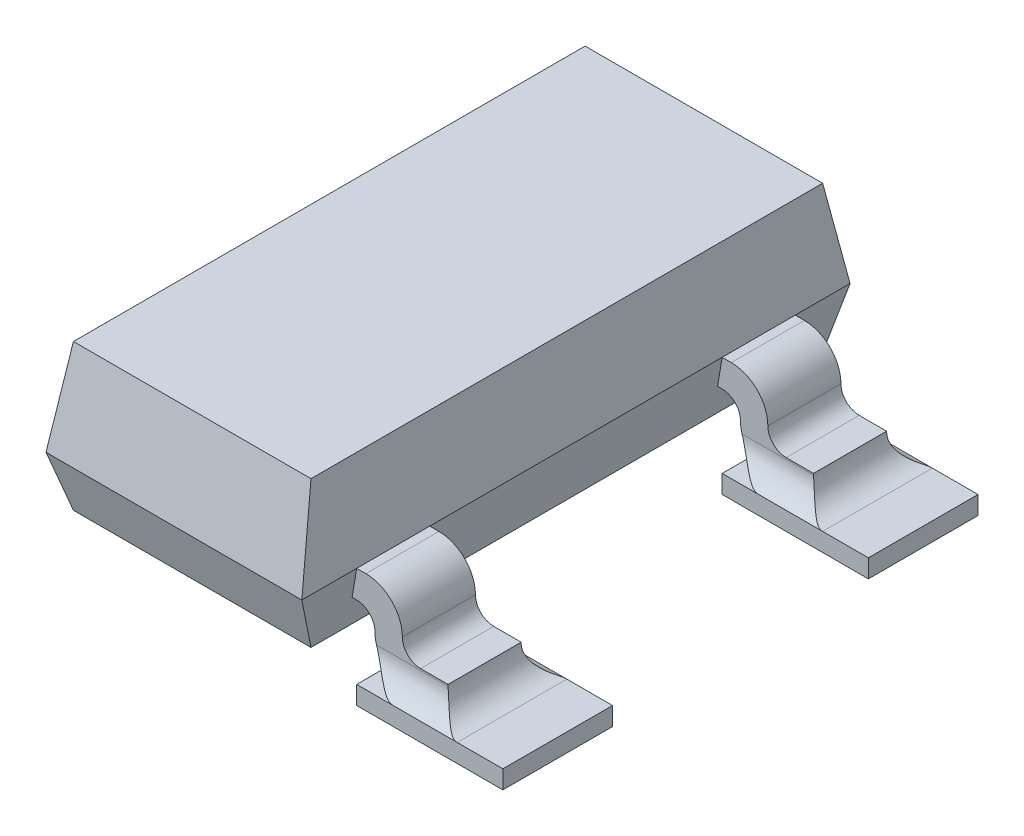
ISO-10303-21;
HEADER;
FILE_DESCRIPTION(('STEP AP214'),'2;1');
FILE_NAME('part.step','',(''),(''),'','','');
FILE_SCHEMA(('AUTOMOTIVE_DESIGN { 1 0 10303 214 1 1 1 1 }'));
ENDSEC;
DATA;
#1=APPLICATION_CONTEXT('core data for automotive mechanical design processes');
#2=APPLICATION_PROTOCOL_DEFINITION('international standard','automotive_design',2000,#1);
#3=PRODUCT_CONTEXT('',#1,'mechanical');
#4=PRODUCT('Part','Part','',(#3));
#5=PRODUCT_RELATED_PRODUCT_CATEGORY('part','',(#4));
#6=PRODUCT_DEFINITION_FORMATION('','',#4);
#7=PRODUCT_DEFINITION_CONTEXT('part definition',#1,'design');
#8=PRODUCT_DEFINITION('design','',#6,#7);
#9=PRODUCT_DEFINITION_SHAPE('','',#8);
#10=(LENGTH_UNIT() NAMED_UNIT(*) SI_UNIT(.MILLI.,.METRE.));
#11=(NAMED_UNIT(*) PLANE_ANGLE_UNIT() SI_UNIT($,.RADIAN.));
#12=(NAMED_UNIT(*) SI_UNIT($,.STERADIAN.) SOLID_ANGLE_UNIT());
#13=UNCERTAINTY_MEASURE_WITH_UNIT(LENGTH_MEASURE(1.E-05),#10,'distance_accuracy_value','');
#14=(GEOMETRIC_REPRESENTATION_CONTEXT(3) GLOBAL_UNCERTAINTY_ASSIGNED_CONTEXT((#13)) GLOBAL_UNIT_ASSIGNED_CONTEXT((#10,
#11,#12)) REPRESENTATION_CONTEXT('',''));
#15=CARTESIAN_POINT('',(0.,0.,0.));
#16=DIRECTION('',(0.,0.,1.));
#17=DIRECTION('',(1.,0.,0.));
#18=AXIS2_PLACEMENT_3D('',#15,#16,#17);
#19=CARTESIAN_POINT('',(0.,-0.45,0.));
#20=DIRECTION('',(0.,-1.,0.));
#21=DIRECTION('',(0.,0.,-1.));
#22=AXIS2_PLACEMENT_3D('',#19,#20,#21);
#23=PLANE('',#22);
#24=DIRECTION('',(1.,0.,0.));
#25=VECTOR('',#24,1.);
#26=CARTESIAN_POINT('',(-1.6,-0.45,1.2));
#27=LINE('',#26,#25);
#28=CARTESIAN_POINT('',(-1.,-0.45,1.2));
#29=VERTEX_POINT('',#28);
#30=CARTESIAN_POINT('',(-0.8,-0.45,1.2));
#31=VERTEX_POINT('',#30);
#32=EDGE_CURVE('E466',#29,#31,#27,.T.);
#33=ORIENTED_EDGE('',*,*,#32,.F.);
#34=DIRECTION('',(0.,0.,1.));
#35=VECTOR('',#34,1.);
#36=CARTESIAN_POINT('',(-1.,-0.45,0.));
#37=LINE('',#36,#35);
#38=CARTESIAN_POINT('',(-1.,-0.45,1.8));
#39=VERTEX_POINT('',#38);
#40=EDGE_CURVE('E750',#29,#39,#37,.T.);
#41=ORIENTED_EDGE('',*,*,#40,.T.);
#42=DIRECTION('',(-1.,0.,0.));
#43=VECTOR('',#42,1.);
#44=CARTESIAN_POINT('',(-1.6,-0.45,1.8));
#45=LINE('',#44,#43);
#46=CARTESIAN_POINT('',(-0.8,-0.45,1.8));
#47=VERTEX_POINT('',#46);
#48=EDGE_CURVE('E457',#47,#39,#45,.T.);
#49=ORIENTED_EDGE('',*,*,#48,.F.);
#50=DIRECTION('',(0.,0.,1.));
#51=VECTOR('',#50,1.);
#52=CARTESIAN_POINT('',(-0.8,-0.45,1.8));
#53=LINE('',#52,#51);
#54=EDGE_CURVE('E470',#31,#47,#53,.T.);
#55=ORIENTED_EDGE('',*,*,#54,.F.);
#56=EDGE_LOOP('',(#33,#41,#49,#55));
#57=FACE_BOUND('',#56,.T.);
#58=ADVANCED_FACE('F32',(#57),#23,.F.);
#59=CARTESIAN_POINT('',(0.,-0.45,0.));
#60=DIRECTION('',(0.,1.,0.));
#61=DIRECTION('',(0.,0.,1.));
#62=AXIS2_PLACEMENT_3D('',#59,#60,#61);
#63=PLANE('',#62);
#64=DIRECTION('',(-1.,0.,0.));
#65=VECTOR('',#64,1.);
#66=CARTESIAN_POINT('',(1.6,-0.45,0.8));
#67=LINE('',#66,#65);
#68=CARTESIAN_POINT('',(1.,-0.45,0.8));
#69=VERTEX_POINT('',#68);
#70=CARTESIAN_POINT('',(0.8,-0.45,0.8));
#71=VERTEX_POINT('',#70);
#72=EDGE_CURVE('E1149',#69,#71,#67,.T.);
#73=ORIENTED_EDGE('',*,*,#72,.F.);
#74=DIRECTION('',(0.,0.,-1.));
#75=VECTOR('',#74,1.);
#76=CARTESIAN_POINT('',(1.,-0.45,0.3));
#77=LINE('',#76,#75);
#78=CARTESIAN_POINT('',(1.,-0.45,0.2));
#79=VERTEX_POINT('',#78);
#80=EDGE_CURVE('E737',#69,#79,#77,.T.);
#81=ORIENTED_EDGE('',*,*,#80,.T.);
#82=DIRECTION('',(1.,0.,0.));
#83=VECTOR('',#82,1.);
#84=CARTESIAN_POINT('',(1.6,-0.45,0.2));
#85=LINE('',#84,#83);
#86=CARTESIAN_POINT('',(0.8,-0.45,0.2));
#87=VERTEX_POINT('',#86);
#88=EDGE_CURVE('E406',#87,#79,#85,.T.);
#89=ORIENTED_EDGE('',*,*,#88,.F.);
#90=DIRECTION('',(0.,0.,-1.));
#91=VECTOR('',#90,1.);
#92=CARTESIAN_POINT('',(0.8,-0.45,0.8));
#93=LINE('',#92,#91);
#94=EDGE_CURVE('E1144',#71,#87,#93,.T.);
#95=ORIENTED_EDGE('',*,*,#94,.F.);
#96=EDGE_LOOP('',(#73,#81,#89,#95));
#97=FACE_BOUND('',#96,.T.);
#98=ADVANCED_FACE('F856',(#97),#63,.T.);
#99=CARTESIAN_POINT('',(0.,-0.45,0.));
#100=DIRECTION('',(0.,1.,0.));
#101=DIRECTION('',(0.,0.,1.));
#102=AXIS2_PLACEMENT_3D('',#99,#100,#101);
#103=PLANE('',#102);
#104=DIRECTION('',(-1.,0.,0.));
#105=VECTOR('',#104,1.);
#106=CARTESIAN_POINT('',(1.6,-0.45,2.8));
#107=LINE('',#106,#105);
#108=CARTESIAN_POINT('',(1.,-0.45,2.8));
#109=VERTEX_POINT('',#108);
#110=CARTESIAN_POINT('',(0.8,-0.45,2.8));
#111=VERTEX_POINT('',#110);
#112=EDGE_CURVE('E414',#109,#111,#107,.T.);
#113=ORIENTED_EDGE('',*,*,#112,.F.);
#114=DIRECTION('',(0.,0.,-1.));
#115=VECTOR('',#114,1.);
#116=CARTESIAN_POINT('',(1.,-0.45,2.3));
#117=LINE('',#116,#115);
#118=CARTESIAN_POINT('',(1.,-0.45,2.2));
#119=VERTEX_POINT('',#118);
#120=EDGE_CURVE('E744',#109,#119,#117,.T.);
#121=ORIENTED_EDGE('',*,*,#120,.T.);
#122=DIRECTION('',(1.,0.,0.));
#123=VECTOR('',#122,1.);
#124=CARTESIAN_POINT('',(1.6,-0.45,2.2));
#125=LINE('',#124,#123);
#126=CARTESIAN_POINT('',(0.8,-0.45,2.2));
#127=VERTEX_POINT('',#126);
#128=EDGE_CURVE('E424',#127,#119,#125,.T.);
#129=ORIENTED_EDGE('',*,*,#128,.F.);
#130=DIRECTION('',(0.,0.,-1.));
#131=VECTOR('',#130,1.);
#132=CARTESIAN_POINT('',(0.8,-0.45,2.8));
#133=LINE('',#132,#131);
#134=EDGE_CURVE('E434',#111,#127,#133,.T.);
#135=ORIENTED_EDGE('',*,*,#134,.F.);
#136=EDGE_LOOP('',(#113,#121,#129,#135));
#137=FACE_BOUND('',#136,.T.);
#138=ADVANCED_FACE('F863',(#137),#103,.T.);
#139=CARTESIAN_POINT('',(0.,-0.15,0.));
#140=DIRECTION('',(0.,1.,0.));
#141=DIRECTION('',(0.,0.,1.));
#142=AXIS2_PLACEMENT_3D('',#139,#140,#141);
#143=PLANE('',#142);
#144=DIRECTION('',(-1.,0.,0.));
#145=VECTOR('',#144,1.);
#146=CARTESIAN_POINT('',(0.65,-0.15,0.3));
#147=LINE('',#146,#145);
#148=CARTESIAN_POINT('',(0.7,-0.15,0.3));
#149=VERTEX_POINT('',#148);
#150=CARTESIAN_POINT('',(0.675,-0.15,0.3));
#151=VERTEX_POINT('',#150);
#152=EDGE_CURVE('E543',#149,#151,#147,.T.);
#153=ORIENTED_EDGE('',*,*,#152,.F.);
#154=DIRECTION('',(0.,0.,-1.));
#155=VECTOR('',#154,1.);
#156=CARTESIAN_POINT('',(0.7,-0.15,0.7));
#157=LINE('',#156,#155);
#158=CARTESIAN_POINT('',(0.7,-0.15,0.7));
#159=VERTEX_POINT('',#158);
#160=EDGE_CURVE('E672',#149,#159,#157,.F.);
#161=ORIENTED_EDGE('',*,*,#160,.T.);
#162=DIRECTION('',(1.,0.,0.));
#163=VECTOR('',#162,1.);
#164=CARTESIAN_POINT('',(0.65,-0.15,0.7));
#165=LINE('',#164,#163);
#166=CARTESIAN_POINT('',(0.675,-0.15,0.7));
#167=VERTEX_POINT('',#166);
#168=EDGE_CURVE('E540',#167,#159,#165,.T.);
#169=ORIENTED_EDGE('',*,*,#168,.F.);
#170=DIRECTION('',(0.,0.,-1.));
#171=VECTOR('',#170,1.);
#172=CARTESIAN_POINT('',(0.675,-0.15,3.));
#173=LINE('',#172,#171);
#174=EDGE_CURVE('E613',#167,#151,#173,.T.);
#175=ORIENTED_EDGE('',*,*,#174,.T.);
#176=EDGE_LOOP('',(#153,#161,#169,#175));
#177=FACE_BOUND('',#176,.T.);
#178=ADVANCED_FACE('F951',(#177),#143,.F.);
#179=CARTESIAN_POINT('',(0.,-0.15,0.));
#180=DIRECTION('',(0.,1.,0.));
#181=DIRECTION('',(0.,0.,1.));
#182=AXIS2_PLACEMENT_3D('',#179,#180,#181);
#183=PLANE('',#182);
#184=DIRECTION('',(-1.,0.,0.));
#185=VECTOR('',#184,1.);
#186=CARTESIAN_POINT('',(0.65,-0.15,2.3));
#187=LINE('',#186,#185);
#188=CARTESIAN_POINT('',(0.7,-0.15,2.3));
#189=VERTEX_POINT('',#188);
#190=CARTESIAN_POINT('',(0.675,-0.15,2.3));
#191=VERTEX_POINT('',#190);
#192=EDGE_CURVE('E533',#189,#191,#187,.T.);
#193=ORIENTED_EDGE('',*,*,#192,.F.);
#194=DIRECTION('',(0.,0.,-1.));
#195=VECTOR('',#194,1.);
#196=CARTESIAN_POINT('',(0.7,-0.15,2.7));
#197=LINE('',#196,#195);
#198=CARTESIAN_POINT('',(0.7,-0.15,2.7));
#199=VERTEX_POINT('',#198);
#200=EDGE_CURVE('E677',#189,#199,#197,.F.);
#201=ORIENTED_EDGE('',*,*,#200,.T.);
#202=DIRECTION('',(1.,0.,0.));
#203=VECTOR('',#202,1.);
#204=CARTESIAN_POINT('',(0.65,-0.15,2.7));
#205=LINE('',#204,#203);
#206=CARTESIAN_POINT('',(0.675,-0.15,2.7));
#207=VERTEX_POINT('',#206);
#208=EDGE_CURVE('E530',#207,#199,#205,.T.);
#209=ORIENTED_EDGE('',*,*,#208,.F.);
#210=DIRECTION('',(0.,0.,-1.));
#211=VECTOR('',#210,1.);
#212=CARTESIAN_POINT('',(0.675,-0.15,3.));
#213=LINE('',#212,#211);
#214=EDGE_CURVE('E622',#207,#191,#213,.T.);
#215=ORIENTED_EDGE('',*,*,#214,.T.);
#216=EDGE_LOOP('',(#193,#201,#209,#215));
#217=FACE_BOUND('',#216,.T.);
#218=ADVANCED_FACE('F947',(#217),#183,.F.);
#219=CARTESIAN_POINT('',(0.,-0.15,0.));
#220=DIRECTION('',(0.,-1.,0.));
#221=DIRECTION('',(0.,0.,-1.));
#222=AXIS2_PLACEMENT_3D('',#219,#220,#221);
#223=PLANE('',#222);
#224=DIRECTION('',(1.,0.,0.));
#225=VECTOR('',#224,1.);
#226=CARTESIAN_POINT('',(-0.65,-0.15,1.7));
#227=LINE('',#226,#225);
#228=CARTESIAN_POINT('',(-0.7,-0.15,1.7));
#229=VERTEX_POINT('',#228);
#230=CARTESIAN_POINT('',(-0.675,-0.15,1.7));
#231=VERTEX_POINT('',#230);
#232=EDGE_CURVE('E523',#229,#231,#227,.T.);
#233=ORIENTED_EDGE('',*,*,#232,.F.);
#234=DIRECTION('',(0.,0.,1.));
#235=VECTOR('',#234,1.);
#236=CARTESIAN_POINT('',(-0.7,-0.15,0.));
#237=LINE('',#236,#235);
#238=CARTESIAN_POINT('',(-0.7,-0.15,1.3));
#239=VERTEX_POINT('',#238);
#240=EDGE_CURVE('E682',#229,#239,#237,.F.);
#241=ORIENTED_EDGE('',*,*,#240,.T.);
#242=DIRECTION('',(-1.,0.,0.));
#243=VECTOR('',#242,1.);
#244=CARTESIAN_POINT('',(-0.65,-0.15,1.3));
#245=LINE('',#244,#243);
#246=CARTESIAN_POINT('',(-0.675,-0.15,1.3));
#247=VERTEX_POINT('',#246);
#248=EDGE_CURVE('E520',#247,#239,#245,.T.);
#249=ORIENTED_EDGE('',*,*,#248,.F.);
#250=DIRECTION('',(0.,0.,-1.));
#251=VECTOR('',#250,1.);
#252=CARTESIAN_POINT('',(-0.675,-0.15,3.));
#253=LINE('',#252,#251);
#254=EDGE_CURVE('E631',#231,#247,#253,.T.);
#255=ORIENTED_EDGE('',*,*,#254,.F.);
#256=EDGE_LOOP('',(#233,#241,#249,#255));
#257=FACE_BOUND('',#256,.T.);
#258=ADVANCED_FACE('F950',(#257),#223,.T.);
#259=CARTESIAN_POINT('',(-0.7,0.,3.));
#260=DIRECTION('',(0.986393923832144,0.164398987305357,0.));
#261=DIRECTION('',(-0.164398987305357,0.986393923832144,0.));
#262=AXIS2_PLACEMENT_3D('',#259,#260,#261);
#263=PLANE('',#262);
#264=DIRECTION('',(0.,0.,-1.));
#265=VECTOR('',#264,1.);
#266=CARTESIAN_POINT('',(-0.7,0.,3.));
#267=LINE('',#266,#265);
#268=CARTESIAN_POINT('',(-0.7,0.,3.));
#269=VERTEX_POINT('',#268);
#270=CARTESIAN_POINT('',(-0.7,0.,1.7));
#271=VERTEX_POINT('',#270);
#272=EDGE_CURVE('E590',#269,#271,#267,.T.);
#273=ORIENTED_EDGE('',*,*,#272,.T.);
#274=DIRECTION('',(0.164398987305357,-0.986393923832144,0.));
#275=VECTOR('',#274,1.);
#276=CARTESIAN_POINT('',(-0.7,0.,1.7));
#277=LINE('',#276,#275);
#278=EDGE_CURVE('E636',#271,#231,#277,.T.);
#279=ORIENTED_EDGE('',*,*,#278,.T.);
#280=ORIENTED_EDGE('',*,*,#254,.T.);
#281=DIRECTION('',(-0.164398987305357,0.986393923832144,0.));
#282=VECTOR('',#281,1.);
#283=CARTESIAN_POINT('',(-0.7,0.,1.3));
#284=LINE('',#283,#282);
#285=CARTESIAN_POINT('',(-0.7,0.,1.3));
#286=VERTEX_POINT('',#285);
#287=EDGE_CURVE('E633',#247,#286,#284,.T.);
#288=ORIENTED_EDGE('',*,*,#287,.T.);
#289=CARTESIAN_POINT('',(-0.7,0.,0.));
#290=VERTEX_POINT('',#289);
#291=EDGE_CURVE('E589',#286,#290,#267,.T.);
#292=ORIENTED_EDGE('',*,*,#291,.T.);
#293=DIRECTION('',(0.156173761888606,-0.937042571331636,0.312347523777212));
#294=VECTOR('',#293,1.);
#295=CARTESIAN_POINT('',(-0.553658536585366,-0.878048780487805,0.292682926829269));
#296=LINE('',#295,#294);
#297=CARTESIAN_POINT('',(-0.65,-0.3,0.1));
#298=VERTEX_POINT('',#297);
#299=EDGE_CURVE('E555',#290,#298,#296,.T.);
#300=ORIENTED_EDGE('',*,*,#299,.T.);
#301=DIRECTION('',(0.,0.,-1.));
#302=VECTOR('',#301,1.);
#303=CARTESIAN_POINT('',(-0.65,-0.3,3.));
#304=LINE('',#303,#302);
#305=CARTESIAN_POINT('',(-0.65,-0.3,2.9));
#306=VERTEX_POINT('',#305);
#307=EDGE_CURVE('E610',#306,#298,#304,.T.);
#308=ORIENTED_EDGE('',*,*,#307,.F.);
#309=DIRECTION('',(-0.156173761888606,0.937042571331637,0.312347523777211));
#310=VECTOR('',#309,1.);
#311=CARTESIAN_POINT('',(-0.7,0.,3.));
#312=LINE('',#311,#310);
#313=EDGE_CURVE('E563',#306,#269,#312,.T.);
#314=ORIENTED_EDGE('',*,*,#313,.T.);
#315=EDGE_LOOP('',(#273,#279,#280,#288,#292,#300,#308,#314));
#316=FACE_BOUND('',#315,.T.);
#317=ADVANCED_FACE('F1012',(#316),#263,.F.);
#318=CARTESIAN_POINT('',(-0.65,-0.3,3.));
#319=DIRECTION('',(0.,1.,0.));
#320=DIRECTION('',(0.,0.,1.));
#321=AXIS2_PLACEMENT_3D('',#318,#319,#320);
#322=PLANE('',#321);
#323=ORIENTED_EDGE('',*,*,#307,.T.);
#324=DIRECTION('',(1.,0.,0.));
#325=VECTOR('',#324,1.);
#326=CARTESIAN_POINT('',(-0.7,-0.3,0.1));
#327=LINE('',#326,#325);
#328=CARTESIAN_POINT('',(0.65,-0.3,0.1));
#329=VERTEX_POINT('',#328);
#330=EDGE_CURVE('E546',#298,#329,#327,.T.);
#331=ORIENTED_EDGE('',*,*,#330,.T.);
#332=DIRECTION('',(0.,0.,-1.));
#333=VECTOR('',#332,1.);
#334=CARTESIAN_POINT('',(0.65,-0.3,3.));
#335=LINE('',#334,#333);
#336=CARTESIAN_POINT('',(0.65,-0.3,2.9));
#337=VERTEX_POINT('',#336);
#338=EDGE_CURVE('E604',#337,#329,#335,.T.);
#339=ORIENTED_EDGE('',*,*,#338,.F.);
#340=DIRECTION('',(1.,0.,0.));
#341=VECTOR('',#340,1.);
#342=CARTESIAN_POINT('',(-0.7,-0.3,2.9));
#343=LINE('',#342,#341);
#344=EDGE_CURVE('E558',#306,#337,#343,.T.);
#345=ORIENTED_EDGE('',*,*,#344,.F.);
#346=EDGE_LOOP('',(#323,#331,#339,#345));
#347=FACE_BOUND('',#346,.T.);
#348=ADVANCED_FACE('F1008',(#347),#322,.F.);
#349=CARTESIAN_POINT('',(0.65,-0.3,3.));
#350=DIRECTION('',(-0.986393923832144,0.164398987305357,0.));
#351=DIRECTION('',(-0.164398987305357,-0.986393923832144,0.));
#352=AXIS2_PLACEMENT_3D('',#349,#350,#351);
#353=PLANE('',#352);
#354=DIRECTION('',(0.,0.,-1.));
#355=VECTOR('',#354,1.);
#356=CARTESIAN_POINT('',(0.7,0.,3.));
#357=LINE('',#356,#355);
#358=CARTESIAN_POINT('',(0.7,0.,2.3));
#359=VERTEX_POINT('',#358);
#360=CARTESIAN_POINT('',(0.7,0.,0.7));
#361=VERTEX_POINT('',#360);
#362=EDGE_CURVE('E606',#359,#361,#357,.T.);
#363=ORIENTED_EDGE('',*,*,#362,.F.);
#364=DIRECTION('',(-0.164398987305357,-0.986393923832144,0.));
#365=VECTOR('',#364,1.);
#366=CARTESIAN_POINT('',(0.65,-0.3,2.3));
#367=LINE('',#366,#365);
#368=EDGE_CURVE('E628',#359,#191,#367,.T.);
#369=ORIENTED_EDGE('',*,*,#368,.T.);
#370=ORIENTED_EDGE('',*,*,#214,.F.);
#371=DIRECTION('',(0.164398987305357,0.986393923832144,0.));
#372=VECTOR('',#371,1.);
#373=CARTESIAN_POINT('',(0.65,-0.3,2.7));
#374=LINE('',#373,#372);
#375=CARTESIAN_POINT('',(0.7,0.,2.7));
#376=VERTEX_POINT('',#375);
#377=EDGE_CURVE('E625',#207,#376,#374,.T.);
#378=ORIENTED_EDGE('',*,*,#377,.T.);
#379=CARTESIAN_POINT('',(0.7,0.,3.));
#380=VERTEX_POINT('',#379);
#381=EDGE_CURVE('E601',#380,#376,#357,.T.);
#382=ORIENTED_EDGE('',*,*,#381,.F.);
#383=DIRECTION('',(-0.156173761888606,-0.937042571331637,-0.312347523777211));
#384=VECTOR('',#383,1.);
#385=CARTESIAN_POINT('',(0.654878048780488,-0.270731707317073,2.90975609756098));
#386=LINE('',#385,#384);
#387=EDGE_CURVE('E560',#380,#337,#386,.T.);
#388=ORIENTED_EDGE('',*,*,#387,.T.);
#389=ORIENTED_EDGE('',*,*,#338,.T.);
#390=DIRECTION('',(0.156173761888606,0.937042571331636,-0.312347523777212));
#391=VECTOR('',#390,1.);
#392=CARTESIAN_POINT('',(0.508536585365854,-1.14878048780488,0.382926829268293));
#393=LINE('',#392,#391);
#394=CARTESIAN_POINT('',(0.7,0.,0.));
#395=VERTEX_POINT('',#394);
#396=EDGE_CURVE('E552',#329,#395,#393,.T.);
#397=ORIENTED_EDGE('',*,*,#396,.T.);
#398=CARTESIAN_POINT('',(0.7,0.,0.3));
#399=VERTEX_POINT('',#398);
#400=EDGE_CURVE('E600',#399,#395,#357,.T.);
#401=ORIENTED_EDGE('',*,*,#400,.F.);
#402=DIRECTION('',(-0.164398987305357,-0.986393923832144,0.));
#403=VECTOR('',#402,1.);
#404=CARTESIAN_POINT('',(0.65,-0.3,0.3));
#405=LINE('',#404,#403);
#406=EDGE_CURVE('E619',#399,#151,#405,.T.);
#407=ORIENTED_EDGE('',*,*,#406,.T.);
#408=ORIENTED_EDGE('',*,*,#174,.F.);
#409=DIRECTION('',(0.164398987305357,0.986393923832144,0.));
#410=VECTOR('',#409,1.);
#411=CARTESIAN_POINT('',(0.65,-0.3,0.7));
#412=LINE('',#411,#410);
#413=EDGE_CURVE('E616',#167,#361,#412,.T.);
#414=ORIENTED_EDGE('',*,*,#413,.T.);
#415=EDGE_LOOP('',(#363,#369,#370,#378,#382,#388,#389,#397,#401,#407,#408,#414));
#416=FACE_BOUND('',#415,.T.);
#417=ADVANCED_FACE('F1004',(#416),#353,.F.);
#418=CARTESIAN_POINT('',(0.7,0.,3.));
#419=DIRECTION('',(-0.995037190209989,-0.099503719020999,0.));
#420=DIRECTION('',(0.099503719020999,-0.995037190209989,0.));
#421=AXIS2_PLACEMENT_3D('',#418,#419,#420);
#422=PLANE('',#421);
#423=ORIENTED_EDGE('',*,*,#381,.T.);
#424=EDGE_CURVE('E605',#376,#359,#357,.T.);
#425=ORIENTED_EDGE('',*,*,#424,.T.);
#426=ORIENTED_EDGE('',*,*,#362,.T.);
#427=EDGE_CURVE('E607',#361,#399,#357,.T.);
#428=ORIENTED_EDGE('',*,*,#427,.T.);
#429=ORIENTED_EDGE('',*,*,#400,.T.);
#430=DIRECTION('',(-0.0975900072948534,0.975900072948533,0.195180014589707));
#431=VECTOR('',#430,1.);
#432=CARTESIAN_POINT('',(0.642857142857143,0.571428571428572,0.114285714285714));
#433=LINE('',#432,#431);
#434=CARTESIAN_POINT('',(0.65,0.5,0.1));
#435=VERTEX_POINT('',#434);
#436=EDGE_CURVE('E574',#395,#435,#433,.T.);
#437=ORIENTED_EDGE('',*,*,#436,.T.);
#438=DIRECTION('',(0.,0.,-1.));
#439=VECTOR('',#438,1.);
#440=CARTESIAN_POINT('',(0.65,0.5,3.));
#441=LINE('',#440,#439);
#442=CARTESIAN_POINT('',(0.65,0.5,2.9));
#443=VERTEX_POINT('',#442);
#444=EDGE_CURVE('E597',#443,#435,#441,.T.);
#445=ORIENTED_EDGE('',*,*,#444,.F.);
#446=DIRECTION('',(0.0975900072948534,-0.975900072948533,0.195180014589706));
#447=VECTOR('',#446,1.);
#448=CARTESIAN_POINT('',(0.7,0.,3.));
#449=LINE('',#448,#447);
#450=EDGE_CURVE('E586',#443,#380,#449,.T.);
#451=ORIENTED_EDGE('',*,*,#450,.T.);
#452=EDGE_LOOP('',(#423,#425,#426,#428,#429,#437,#445,#451));
#453=FACE_BOUND('',#452,.T.);
#454=ADVANCED_FACE('F1000',(#453),#422,.F.);
#455=CARTESIAN_POINT('',(0.65,0.5,3.));
#456=DIRECTION('',(0.,-1.,0.));
#457=DIRECTION('',(0.,0.,-1.));
#458=AXIS2_PLACEMENT_3D('',#455,#456,#457);
#459=PLANE('',#458);
#460=ORIENTED_EDGE('',*,*,#444,.T.);
#461=DIRECTION('',(1.,0.,0.));
#462=VECTOR('',#461,1.);
#463=CARTESIAN_POINT('',(-0.7,0.5,0.1));
#464=LINE('',#463,#462);
#465=CARTESIAN_POINT('',(-0.65,0.5,0.1));
#466=VERTEX_POINT('',#465);
#467=EDGE_CURVE('E567',#466,#435,#464,.T.);
#468=ORIENTED_EDGE('',*,*,#467,.F.);
#469=DIRECTION('',(0.,0.,-1.));
#470=VECTOR('',#469,1.);
#471=CARTESIAN_POINT('',(-0.65,0.5,3.));
#472=LINE('',#471,#470);
#473=CARTESIAN_POINT('',(-0.65,0.5,2.9));
#474=VERTEX_POINT('',#473);
#475=EDGE_CURVE('E593',#474,#466,#472,.T.);
#476=ORIENTED_EDGE('',*,*,#475,.F.);
#477=DIRECTION('',(1.,0.,0.));
#478=VECTOR('',#477,1.);
#479=CARTESIAN_POINT('',(-0.7,0.5,2.9));
#480=LINE('',#479,#478);
#481=EDGE_CURVE('E578',#474,#443,#480,.T.);
#482=ORIENTED_EDGE('',*,*,#481,.T.);
#483=EDGE_LOOP('',(#460,#468,#476,#482));
#484=FACE_BOUND('',#483,.T.);
#485=ADVANCED_FACE('F996',(#484),#459,.F.);
#486=CARTESIAN_POINT('',(-0.65,0.5,3.));
#487=DIRECTION('',(0.995037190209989,-0.099503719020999,0.));
#488=DIRECTION('',(0.099503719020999,0.995037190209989,0.));
#489=AXIS2_PLACEMENT_3D('',#486,#487,#488);
#490=PLANE('',#489);
#491=ORIENTED_EDGE('',*,*,#475,.T.);
#492=DIRECTION('',(-0.0975900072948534,-0.975900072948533,-0.195180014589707));
#493=VECTOR('',#492,1.);
#494=CARTESIAN_POINT('',(-0.594761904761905,1.05238095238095,0.210476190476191));
#495=LINE('',#494,#493);
#496=EDGE_CURVE('E569',#466,#290,#495,.T.);
#497=ORIENTED_EDGE('',*,*,#496,.T.);
#498=ORIENTED_EDGE('',*,*,#291,.F.);
#499=EDGE_CURVE('E594',#271,#286,#267,.T.);
#500=ORIENTED_EDGE('',*,*,#499,.F.);
#501=ORIENTED_EDGE('',*,*,#272,.F.);
#502=DIRECTION('',(0.0975900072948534,0.975900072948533,-0.195180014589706));
#503=VECTOR('',#502,1.);
#504=CARTESIAN_POINT('',(-0.651904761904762,0.480952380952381,2.90380952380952));
#505=LINE('',#504,#503);
#506=EDGE_CURVE('E581',#269,#474,#505,.T.);
#507=ORIENTED_EDGE('',*,*,#506,.T.);
#508=EDGE_LOOP('',(#491,#497,#498,#500,#501,#507));
#509=FACE_BOUND('',#508,.T.);
#510=ADVANCED_FACE('F992',(#509),#490,.F.);
#511=CARTESIAN_POINT('',(-0.7,0.,3.));
#512=DIRECTION('',(0.,-0.196116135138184,-0.98058067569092));
#513=DIRECTION('',(0.,0.98058067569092,-0.196116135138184));
#514=AXIS2_PLACEMENT_3D('',#511,#512,#513);
#515=PLANE('',#514);
#516=ORIENTED_EDGE('',*,*,#481,.F.);
#517=ORIENTED_EDGE('',*,*,#506,.F.);
#518=DIRECTION('',(1.,0.,0.));
#519=VECTOR('',#518,1.);
#520=CARTESIAN_POINT('',(-0.7,0.,3.));
#521=LINE('',#520,#519);
#522=EDGE_CURVE('E577',#269,#380,#521,.T.);
#523=ORIENTED_EDGE('',*,*,#522,.T.);
#524=ORIENTED_EDGE('',*,*,#450,.F.);
#525=EDGE_LOOP('',(#516,#517,#523,#524));
#526=FACE_BOUND('',#525,.T.);
#527=ADVANCED_FACE('F988',(#526),#515,.F.);
#528=CARTESIAN_POINT('',(-0.7,0.5,0.1));
#529=DIRECTION('',(0.,-0.196116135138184,0.98058067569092));
#530=DIRECTION('',(0.,-0.98058067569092,-0.196116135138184));
#531=AXIS2_PLACEMENT_3D('',#528,#529,#530);
#532=PLANE('',#531);
#533=DIRECTION('',(1.,0.,0.));
#534=VECTOR('',#533,1.);
#535=CARTESIAN_POINT('',(-0.7,0.,0.));
#536=LINE('',#535,#534);
#537=EDGE_CURVE('E566',#290,#395,#536,.T.);
#538=ORIENTED_EDGE('',*,*,#537,.F.);
#539=ORIENTED_EDGE('',*,*,#496,.F.);
#540=ORIENTED_EDGE('',*,*,#467,.T.);
#541=ORIENTED_EDGE('',*,*,#436,.F.);
#542=EDGE_LOOP('',(#538,#539,#540,#541));
#543=FACE_BOUND('',#542,.T.);
#544=ADVANCED_FACE('F984',(#543),#532,.F.);
#545=CARTESIAN_POINT('',(-0.7,0.,3.));
#546=DIRECTION('',(0.,0.316227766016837,-0.948683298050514));
#547=DIRECTION('',(0.,0.948683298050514,0.316227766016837));
#548=AXIS2_PLACEMENT_3D('',#545,#546,#547);
#549=PLANE('',#548);
#550=ORIENTED_EDGE('',*,*,#344,.T.);
#551=ORIENTED_EDGE('',*,*,#387,.F.);
#552=ORIENTED_EDGE('',*,*,#522,.F.);
#553=ORIENTED_EDGE('',*,*,#313,.F.);
#554=EDGE_LOOP('',(#550,#551,#552,#553));
#555=FACE_BOUND('',#554,.T.);
#556=ADVANCED_FACE('F980',(#555),#549,.F.);
#557=CARTESIAN_POINT('',(-0.7,0.,0.));
#558=DIRECTION('',(0.,0.316227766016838,0.948683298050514));
#559=DIRECTION('',(0.,-0.948683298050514,0.316227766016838));
#560=AXIS2_PLACEMENT_3D('',#557,#558,#559);
#561=PLANE('',#560);
#562=ORIENTED_EDGE('',*,*,#537,.T.);
#563=ORIENTED_EDGE('',*,*,#396,.F.);
#564=ORIENTED_EDGE('',*,*,#330,.F.);
#565=ORIENTED_EDGE('',*,*,#299,.F.);
#566=EDGE_LOOP('',(#562,#563,#564,#565));
#567=FACE_BOUND('',#566,.T.);
#568=ADVANCED_FACE('F973',(#567),#561,.F.);
#569=CARTESIAN_POINT('',(0.65,-0.15,0.3));
#570=DIRECTION('',(0.,0.,-1.));
#571=DIRECTION('',(-1.,0.,0.));
#572=AXIS2_PLACEMENT_3D('',#569,#570,#571);
#573=PLANE('',#572);
#574=DIRECTION('',(1.,0.,0.));
#575=VECTOR('',#574,1.);
#576=CARTESIAN_POINT('',(0.8,-0.3,0.3));
#577=LINE('',#576,#575);
#578=CARTESIAN_POINT('',(1.05,-0.3,0.3));
#579=VERTEX_POINT('',#578);
#580=CARTESIAN_POINT('',(1.2,-0.3,0.3));
#581=VERTEX_POINT('',#580);
#582=EDGE_CURVE('E488',#579,#581,#577,.T.);
#583=ORIENTED_EDGE('',*,*,#582,.T.);
#584=CARTESIAN_POINT('',(1.35,-0.3,0.3));
#585=DIRECTION('',(0.,0.,-1.));
#586=DIRECTION('',(-1.,0.,0.));
#587=AXIS2_PLACEMENT_3D('',#584,#585,#586);
#588=CIRCLE('',#587,0.15);
#589=CARTESIAN_POINT('',(1.20024551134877,-0.30857864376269,0.3));
#590=VERTEX_POINT('',#589);
#591=EDGE_CURVE('E815',#581,#590,#588,.F.);
#592=ORIENTED_EDGE('',*,*,#591,.T.);
#593=DIRECTION('',(-1.,0.,0.));
#594=VECTOR('',#593,1.);
#595=CARTESIAN_POINT('',(1.,-0.30857864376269,0.3));
#596=LINE('',#595,#594);
#597=CARTESIAN_POINT('',(0.808770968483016,-0.30857864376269,0.3));
#598=VERTEX_POINT('',#597);
#599=EDGE_CURVE('E765',#590,#598,#596,.T.);
#600=ORIENTED_EDGE('',*,*,#599,.T.);
#601=CARTESIAN_POINT('',(1.,-0.25,0.3));
#602=DIRECTION('',(0.,0.,-1.));
#603=DIRECTION('',(-1.,0.,0.));
#604=AXIS2_PLACEMENT_3D('',#601,#602,#603);
#605=CIRCLE('',#604,0.2);
#606=CARTESIAN_POINT('',(0.8,-0.25,0.3));
#607=VERTEX_POINT('',#606);
#608=EDGE_CURVE('E739',#598,#607,#605,.T.);
#609=ORIENTED_EDGE('',*,*,#608,.T.);
#610=CARTESIAN_POINT('',(0.7,-0.25,0.3));
#611=DIRECTION('',(0.,0.,-1.));
#612=DIRECTION('',(-1.,0.,0.));
#613=AXIS2_PLACEMENT_3D('',#610,#611,#612);
#614=CIRCLE('',#613,0.1);
#615=EDGE_CURVE('E684',#607,#149,#614,.F.);
#616=ORIENTED_EDGE('',*,*,#615,.T.);
#617=ORIENTED_EDGE('',*,*,#152,.T.);
#618=ORIENTED_EDGE('',*,*,#406,.F.);
#619=DIRECTION('',(-1.,0.,0.));
#620=VECTOR('',#619,1.);
#621=CARTESIAN_POINT('',(0.65,0.,0.3));
#622=LINE('',#621,#620);
#623=CARTESIAN_POINT('',(0.75,0.,0.3));
#624=VERTEX_POINT('',#623);
#625=EDGE_CURVE('E544',#624,#399,#622,.T.);
#626=ORIENTED_EDGE('',*,*,#625,.F.);
#627=CARTESIAN_POINT('',(0.75,-0.2,0.3));
#628=DIRECTION('',(0.,0.,-1.));
#629=DIRECTION('',(-1.,0.,0.));
#630=AXIS2_PLACEMENT_3D('',#627,#628,#629);
#631=CIRCLE('',#630,0.2);
#632=CARTESIAN_POINT('',(0.95,-0.2,0.3));
#633=VERTEX_POINT('',#632);
#634=EDGE_CURVE('E642',#624,#633,#631,.T.);
#635=ORIENTED_EDGE('',*,*,#634,.T.);
#636=CARTESIAN_POINT('',(1.05,-0.2,0.3));
#637=DIRECTION('',(0.,0.,-1.));
#638=DIRECTION('',(-1.,0.,0.));
#639=AXIS2_PLACEMENT_3D('',#636,#637,#638);
#640=CIRCLE('',#639,0.1);
#641=EDGE_CURVE('E731',#633,#579,#640,.F.);
#642=ORIENTED_EDGE('',*,*,#641,.T.);
#643=EDGE_LOOP('',(#583,#592,#600,#609,#616,#617,#618,#626,#635,#642));
#644=FACE_BOUND('',#643,.T.);
#645=ADVANCED_FACE('F970',(#644),#573,.T.);
#646=CARTESIAN_POINT('',(0.65,-0.15,0.7));
#647=DIRECTION('',(0.,0.,1.));
#648=DIRECTION('',(1.,0.,0.));
#649=AXIS2_PLACEMENT_3D('',#646,#647,#648);
#650=PLANE('',#649);
#651=CARTESIAN_POINT('',(1.,-0.25,0.7));
#652=DIRECTION('',(0.,0.,1.));
#653=DIRECTION('',(1.,0.,0.));
#654=AXIS2_PLACEMENT_3D('',#651,#652,#653);
#655=CIRCLE('',#654,0.2);
#656=CARTESIAN_POINT('',(0.8,-0.25,0.7));
#657=VERTEX_POINT('',#656);
#658=CARTESIAN_POINT('',(0.808770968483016,-0.308578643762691,0.7));
#659=VERTEX_POINT('',#658);
#660=EDGE_CURVE('E741',#657,#659,#655,.T.);
#661=ORIENTED_EDGE('',*,*,#660,.T.);
#662=DIRECTION('',(1.,0.,0.));
#663=VECTOR('',#662,1.);
#664=CARTESIAN_POINT('',(1.2,-0.308578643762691,0.7));
#665=LINE('',#664,#663);
#666=CARTESIAN_POINT('',(1.20024551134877,-0.308578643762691,0.7));
#667=VERTEX_POINT('',#666);
#668=EDGE_CURVE('E763',#659,#667,#665,.T.);
#669=ORIENTED_EDGE('',*,*,#668,.T.);
#670=CARTESIAN_POINT('',(1.35,-0.3,0.7));
#671=DIRECTION('',(0.,0.,1.));
#672=DIRECTION('',(1.,0.,0.));
#673=AXIS2_PLACEMENT_3D('',#670,#671,#672);
#674=CIRCLE('',#673,0.15);
#675=CARTESIAN_POINT('',(1.2,-0.3,0.7));
#676=VERTEX_POINT('',#675);
#677=EDGE_CURVE('E1113',#667,#676,#674,.F.);
#678=ORIENTED_EDGE('',*,*,#677,.T.);
#679=DIRECTION('',(-1.,0.,0.));
#680=VECTOR('',#679,1.);
#681=CARTESIAN_POINT('',(0.8,-0.3,0.7));
#682=LINE('',#681,#680);
#683=CARTESIAN_POINT('',(1.05,-0.3,0.7));
#684=VERTEX_POINT('',#683);
#685=EDGE_CURVE('E698',#676,#684,#682,.T.);
#686=ORIENTED_EDGE('',*,*,#685,.T.);
#687=CARTESIAN_POINT('',(1.05,-0.2,0.7));
#688=DIRECTION('',(0.,0.,1.));
#689=DIRECTION('',(1.,0.,0.));
#690=AXIS2_PLACEMENT_3D('',#687,#688,#689);
#691=CIRCLE('',#690,0.1);
#692=CARTESIAN_POINT('',(0.95,-0.2,0.7));
#693=VERTEX_POINT('',#692);
#694=EDGE_CURVE('E726',#684,#693,#691,.F.);
#695=ORIENTED_EDGE('',*,*,#694,.T.);
#696=CARTESIAN_POINT('',(0.75,-0.2,0.7));
#697=DIRECTION('',(0.,0.,1.));
#698=DIRECTION('',(1.,0.,0.));
#699=AXIS2_PLACEMENT_3D('',#696,#697,#698);
#700=CIRCLE('',#699,0.2);
#701=CARTESIAN_POINT('',(0.75,0.,0.7));
#702=VERTEX_POINT('',#701);
#703=EDGE_CURVE('E647',#693,#702,#700,.T.);
#704=ORIENTED_EDGE('',*,*,#703,.T.);
#705=DIRECTION('',(1.,0.,0.));
#706=VECTOR('',#705,1.);
#707=CARTESIAN_POINT('',(0.65,0.,0.7));
#708=LINE('',#707,#706);
#709=EDGE_CURVE('E536',#361,#702,#708,.T.);
#710=ORIENTED_EDGE('',*,*,#709,.F.);
#711=ORIENTED_EDGE('',*,*,#413,.F.);
#712=ORIENTED_EDGE('',*,*,#168,.T.);
#713=CARTESIAN_POINT('',(0.7,-0.25,0.7));
#714=DIRECTION('',(0.,0.,1.));
#715=DIRECTION('',(1.,0.,0.));
#716=AXIS2_PLACEMENT_3D('',#713,#714,#715);
#717=CIRCLE('',#716,0.1);
#718=EDGE_CURVE('E686',#159,#657,#717,.F.);
#719=ORIENTED_EDGE('',*,*,#718,.T.);
#720=EDGE_LOOP('',(#661,#669,#678,#686,#695,#704,#710,#711,#712,#719));
#721=FACE_BOUND('',#720,.T.);
#722=ADVANCED_FACE('F968',(#721),#650,.T.);
#723=CARTESIAN_POINT('',(0.,0.,0.));
#724=DIRECTION('',(0.,1.,0.));
#725=DIRECTION('',(0.,0.,1.));
#726=AXIS2_PLACEMENT_3D('',#723,#724,#725);
#727=PLANE('',#726);
#728=ORIENTED_EDGE('',*,*,#709,.T.);
#729=DIRECTION('',(0.,0.,-1.));
#730=VECTOR('',#729,1.);
#731=CARTESIAN_POINT('',(0.75,0.,0.));
#732=LINE('',#731,#730);
#733=EDGE_CURVE('E639',#702,#624,#732,.T.);
#734=ORIENTED_EDGE('',*,*,#733,.T.);
#735=ORIENTED_EDGE('',*,*,#625,.T.);
#736=ORIENTED_EDGE('',*,*,#427,.F.);
#737=EDGE_LOOP('',(#728,#734,#735,#736));
#738=FACE_BOUND('',#737,.T.);
#739=ADVANCED_FACE('F959',(#738),#727,.T.);
#740=CARTESIAN_POINT('',(0.65,-0.15,2.3));
#741=DIRECTION('',(0.,0.,-1.));
#742=DIRECTION('',(-1.,0.,0.));
#743=AXIS2_PLACEMENT_3D('',#740,#741,#742);
#744=PLANE('',#743);
#745=DIRECTION('',(1.,0.,0.));
#746=VECTOR('',#745,1.);
#747=CARTESIAN_POINT('',(0.8,-0.3,2.3));
#748=LINE('',#747,#746);
#749=CARTESIAN_POINT('',(1.05,-0.3,2.3));
#750=VERTEX_POINT('',#749);
#751=CARTESIAN_POINT('',(1.2,-0.3,2.3));
#752=VERTEX_POINT('',#751);
#753=EDGE_CURVE('E695',#750,#752,#748,.T.);
#754=ORIENTED_EDGE('',*,*,#753,.T.);
#755=CARTESIAN_POINT('',(1.35,-0.3,2.3));
#756=DIRECTION('',(0.,0.,-1.));
#757=DIRECTION('',(-1.,0.,0.));
#758=AXIS2_PLACEMENT_3D('',#755,#756,#757);
#759=CIRCLE('',#758,0.15);
#760=CARTESIAN_POINT('',(1.20024551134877,-0.30857864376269,2.3));
#761=VERTEX_POINT('',#760);
#762=EDGE_CURVE('E1080',#752,#761,#759,.F.);
#763=ORIENTED_EDGE('',*,*,#762,.T.);
#764=DIRECTION('',(-1.,0.,0.));
#765=VECTOR('',#764,1.);
#766=CARTESIAN_POINT('',(1.,-0.30857864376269,2.3));
#767=LINE('',#766,#765);
#768=CARTESIAN_POINT('',(0.808770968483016,-0.30857864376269,2.3));
#769=VERTEX_POINT('',#768);
#770=EDGE_CURVE('E767',#761,#769,#767,.T.);
#771=ORIENTED_EDGE('',*,*,#770,.T.);
#772=CARTESIAN_POINT('',(1.,-0.25,2.3));
#773=DIRECTION('',(0.,0.,-1.));
#774=DIRECTION('',(-1.,0.,0.));
#775=AXIS2_PLACEMENT_3D('',#772,#773,#774);
#776=CIRCLE('',#775,0.2);
#777=CARTESIAN_POINT('',(0.8,-0.25,2.3));
#778=VERTEX_POINT('',#777);
#779=EDGE_CURVE('E746',#769,#778,#776,.T.);
#780=ORIENTED_EDGE('',*,*,#779,.T.);
#781=CARTESIAN_POINT('',(0.7,-0.25,2.3));
#782=DIRECTION('',(0.,0.,-1.));
#783=DIRECTION('',(-1.,0.,0.));
#784=AXIS2_PLACEMENT_3D('',#781,#782,#783);
#785=CIRCLE('',#784,0.1);
#786=EDGE_CURVE('E688',#778,#189,#785,.F.);
#787=ORIENTED_EDGE('',*,*,#786,.T.);
#788=ORIENTED_EDGE('',*,*,#192,.T.);
#789=ORIENTED_EDGE('',*,*,#368,.F.);
#790=DIRECTION('',(-1.,0.,0.));
#791=VECTOR('',#790,1.);
#792=CARTESIAN_POINT('',(0.65,0.,2.3));
#793=LINE('',#792,#791);
#794=CARTESIAN_POINT('',(0.75,0.,2.3));
#795=VERTEX_POINT('',#794);
#796=EDGE_CURVE('E534',#795,#359,#793,.T.);
#797=ORIENTED_EDGE('',*,*,#796,.F.);
#798=CARTESIAN_POINT('',(0.75,-0.2,2.3));
#799=DIRECTION('',(0.,0.,-1.));
#800=DIRECTION('',(-1.,0.,0.));
#801=AXIS2_PLACEMENT_3D('',#798,#799,#800);
#802=CIRCLE('',#801,0.2);
#803=CARTESIAN_POINT('',(0.95,-0.2,2.3));
#804=VERTEX_POINT('',#803);
#805=EDGE_CURVE('E652',#795,#804,#802,.T.);
#806=ORIENTED_EDGE('',*,*,#805,.T.);
#807=CARTESIAN_POINT('',(1.05,-0.2,2.3));
#808=DIRECTION('',(0.,0.,-1.));
#809=DIRECTION('',(-1.,0.,0.));
#810=AXIS2_PLACEMENT_3D('',#807,#808,#809);
#811=CIRCLE('',#810,0.1);
#812=EDGE_CURVE('E724',#804,#750,#811,.F.);
#813=ORIENTED_EDGE('',*,*,#812,.T.);
#814=EDGE_LOOP('',(#754,#763,#771,#780,#787,#788,#789,#797,#806,#813));
#815=FACE_BOUND('',#814,.T.);
#816=ADVANCED_FACE('F956',(#815),#744,.T.);
#817=CARTESIAN_POINT('',(0.65,-0.15,2.7));
#818=DIRECTION('',(0.,0.,1.));
#819=DIRECTION('',(1.,0.,0.));
#820=AXIS2_PLACEMENT_3D('',#817,#818,#819);
#821=PLANE('',#820);
#822=CARTESIAN_POINT('',(1.,-0.25,2.7));
#823=DIRECTION('',(0.,0.,1.));
#824=DIRECTION('',(1.,0.,0.));
#825=AXIS2_PLACEMENT_3D('',#822,#823,#824);
#826=CIRCLE('',#825,0.2);
#827=CARTESIAN_POINT('',(0.8,-0.25,2.7));
#828=VERTEX_POINT('',#827);
#829=CARTESIAN_POINT('',(0.808770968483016,-0.308578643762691,2.7));
#830=VERTEX_POINT('',#829);
#831=EDGE_CURVE('E748',#828,#830,#826,.T.);
#832=ORIENTED_EDGE('',*,*,#831,.T.);
#833=DIRECTION('',(1.,0.,0.));
#834=VECTOR('',#833,1.);
#835=CARTESIAN_POINT('',(1.2,-0.308578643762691,2.7));
#836=LINE('',#835,#834);
#837=CARTESIAN_POINT('',(1.20024551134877,-0.308578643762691,2.7));
#838=VERTEX_POINT('',#837);
#839=EDGE_CURVE('E759',#830,#838,#836,.T.);
#840=ORIENTED_EDGE('',*,*,#839,.T.);
#841=CARTESIAN_POINT('',(1.35,-0.3,2.7));
#842=DIRECTION('',(0.,0.,1.));
#843=DIRECTION('',(1.,0.,0.));
#844=AXIS2_PLACEMENT_3D('',#841,#842,#843);
#845=CIRCLE('',#844,0.15);
#846=CARTESIAN_POINT('',(1.2,-0.3,2.7));
#847=VERTEX_POINT('',#846);
#848=EDGE_CURVE('E715',#838,#847,#845,.F.);
#849=ORIENTED_EDGE('',*,*,#848,.T.);
#850=DIRECTION('',(-1.,0.,0.));
#851=VECTOR('',#850,1.);
#852=CARTESIAN_POINT('',(0.8,-0.3,2.7));
#853=LINE('',#852,#851);
#854=CARTESIAN_POINT('',(1.05,-0.3,2.7));
#855=VERTEX_POINT('',#854);
#856=EDGE_CURVE('E506',#847,#855,#853,.T.);
#857=ORIENTED_EDGE('',*,*,#856,.T.);
#858=CARTESIAN_POINT('',(1.05,-0.2,2.7));
#859=DIRECTION('',(0.,0.,1.));
#860=DIRECTION('',(1.,0.,0.));
#861=AXIS2_PLACEMENT_3D('',#858,#859,#860);
#862=CIRCLE('',#861,0.1);
#863=CARTESIAN_POINT('',(0.95,-0.2,2.7));
#864=VERTEX_POINT('',#863);
#865=EDGE_CURVE('E713',#855,#864,#862,.F.);
#866=ORIENTED_EDGE('',*,*,#865,.T.);
#867=CARTESIAN_POINT('',(0.75,-0.2,2.7));
#868=DIRECTION('',(0.,0.,1.));
#869=DIRECTION('',(1.,0.,0.));
#870=AXIS2_PLACEMENT_3D('',#867,#868,#869);
#871=CIRCLE('',#870,0.2);
#872=CARTESIAN_POINT('',(0.75,0.,2.7));
#873=VERTEX_POINT('',#872);
#874=EDGE_CURVE('E657',#864,#873,#871,.T.);
#875=ORIENTED_EDGE('',*,*,#874,.T.);
#876=DIRECTION('',(1.,0.,0.));
#877=VECTOR('',#876,1.);
#878=CARTESIAN_POINT('',(0.65,0.,2.7));
#879=LINE('',#878,#877);
#880=EDGE_CURVE('E526',#376,#873,#879,.T.);
#881=ORIENTED_EDGE('',*,*,#880,.F.);
#882=ORIENTED_EDGE('',*,*,#377,.F.);
#883=ORIENTED_EDGE('',*,*,#208,.T.);
#884=CARTESIAN_POINT('',(0.7,-0.25,2.7));
#885=DIRECTION('',(0.,0.,1.));
#886=DIRECTION('',(1.,0.,0.));
#887=AXIS2_PLACEMENT_3D('',#884,#885,#886);
#888=CIRCLE('',#887,0.1);
#889=EDGE_CURVE('E690',#199,#828,#888,.F.);
#890=ORIENTED_EDGE('',*,*,#889,.T.);
#891=EDGE_LOOP('',(#832,#840,#849,#857,#866,#875,#881,#882,#883,#890));
#892=FACE_BOUND('',#891,.T.);
#893=ADVANCED_FACE('F712',(#892),#821,.T.);
#894=CARTESIAN_POINT('',(0.,0.,0.));
#895=DIRECTION('',(0.,1.,0.));
#896=DIRECTION('',(0.,0.,1.));
#897=AXIS2_PLACEMENT_3D('',#894,#895,#896);
#898=PLANE('',#897);
#899=ORIENTED_EDGE('',*,*,#880,.T.);
#900=DIRECTION('',(0.,0.,-1.));
#901=VECTOR('',#900,1.);
#902=CARTESIAN_POINT('',(0.75,0.,0.));
#903=LINE('',#902,#901);
#904=EDGE_CURVE('E649',#873,#795,#903,.T.);
#905=ORIENTED_EDGE('',*,*,#904,.T.);
#906=ORIENTED_EDGE('',*,*,#796,.T.);
#907=ORIENTED_EDGE('',*,*,#424,.F.);
#908=EDGE_LOOP('',(#899,#905,#906,#907));
#909=FACE_BOUND('',#908,.T.);
#910=ADVANCED_FACE('F941',(#909),#898,.T.);
#911=CARTESIAN_POINT('',(-0.65,-0.15,1.7));
#912=DIRECTION('',(0.,0.,1.));
#913=DIRECTION('',(1.,0.,0.));
#914=AXIS2_PLACEMENT_3D('',#911,#912,#913);
#915=PLANE('',#914);
#916=DIRECTION('',(-1.,0.,0.));
#917=VECTOR('',#916,1.);
#918=CARTESIAN_POINT('',(-0.8,-0.3,1.7));
#919=LINE('',#918,#917);
#920=CARTESIAN_POINT('',(-1.05,-0.3,1.7));
#921=VERTEX_POINT('',#920);
#922=CARTESIAN_POINT('',(-1.2,-0.3,1.7));
#923=VERTEX_POINT('',#922);
#924=EDGE_CURVE('E502',#921,#923,#919,.T.);
#925=ORIENTED_EDGE('',*,*,#924,.T.);
#926=CARTESIAN_POINT('',(-1.35,-0.3,1.7));
#927=DIRECTION('',(0.,0.,1.));
#928=DIRECTION('',(1.,0.,0.));
#929=AXIS2_PLACEMENT_3D('',#926,#927,#928);
#930=CIRCLE('',#929,0.15);
#931=CARTESIAN_POINT('',(-1.20024551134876,-0.30857864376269,1.7));
#932=VERTEX_POINT('',#931);
#933=EDGE_CURVE('E11',#923,#932,#930,.F.);
#934=ORIENTED_EDGE('',*,*,#933,.T.);
#935=CARTESIAN_POINT('',(-1.20024551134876,-0.30857864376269,1.7));
#936=CARTESIAN_POINT('',(-1.2,-0.30857864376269,1.7));
#937=B_SPLINE_CURVE_WITH_KNOTS('',1,(#935,#936),.UNSPECIFIED.,.F.,.F.,(2,2),(0.,1.),.UNSPECIFIED.);
#938=CARTESIAN_POINT('',(-1.2,-0.30857864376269,1.7));
#939=VERTEX_POINT('',#938);
#940=EDGE_CURVE('E894',#932,#939,#937,.T.);
#941=ORIENTED_EDGE('',*,*,#940,.T.);
#942=DIRECTION('',(-1.,0.,0.));
#943=VECTOR('',#942,1.);
#944=CARTESIAN_POINT('',(-1.,-0.30857864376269,1.7));
#945=LINE('',#944,#943);
#946=CARTESIAN_POINT('',(-0.808770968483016,-0.30857864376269,1.7));
#947=VERTEX_POINT('',#946);
#948=EDGE_CURVE('E773',#939,#947,#945,.F.);
#949=ORIENTED_EDGE('',*,*,#948,.T.);
#950=CARTESIAN_POINT('',(-1.,-0.25,1.7));
#951=DIRECTION('',(0.,0.,1.));
#952=DIRECTION('',(1.,0.,0.));
#953=AXIS2_PLACEMENT_3D('',#950,#951,#952);
#954=CIRCLE('',#953,0.2);
#955=CARTESIAN_POINT('',(-0.8,-0.25,1.7));
#956=VERTEX_POINT('',#955);
#957=EDGE_CURVE('E752',#947,#956,#954,.T.);
#958=ORIENTED_EDGE('',*,*,#957,.T.);
#959=CARTESIAN_POINT('',(-0.7,-0.25,1.7));
#960=DIRECTION('',(0.,0.,1.));
#961=DIRECTION('',(1.,0.,0.));
#962=AXIS2_PLACEMENT_3D('',#959,#960,#961);
#963=CIRCLE('',#962,0.1);
#964=EDGE_CURVE('E692',#956,#229,#963,.F.);
#965=ORIENTED_EDGE('',*,*,#964,.T.);
#966=ORIENTED_EDGE('',*,*,#232,.T.);
#967=ORIENTED_EDGE('',*,*,#278,.F.);
#968=DIRECTION('',(1.,0.,0.));
#969=VECTOR('',#968,1.);
#970=CARTESIAN_POINT('',(-0.65,0.,1.7));
#971=LINE('',#970,#969);
#972=CARTESIAN_POINT('',(-0.75,0.,1.7));
#973=VERTEX_POINT('',#972);
#974=EDGE_CURVE('E524',#973,#271,#971,.T.);
#975=ORIENTED_EDGE('',*,*,#974,.F.);
#976=CARTESIAN_POINT('',(-0.75,-0.2,1.7));
#977=DIRECTION('',(0.,0.,1.));
#978=DIRECTION('',(1.,0.,0.));
#979=AXIS2_PLACEMENT_3D('',#976,#977,#978);
#980=CIRCLE('',#979,0.2);
#981=CARTESIAN_POINT('',(-0.95,-0.2,1.7));
#982=VERTEX_POINT('',#981);
#983=EDGE_CURVE('E662',#973,#982,#980,.T.);
#984=ORIENTED_EDGE('',*,*,#983,.T.);
#985=CARTESIAN_POINT('',(-1.05,-0.2,1.7));
#986=DIRECTION('',(0.,0.,1.));
#987=DIRECTION('',(1.,0.,0.));
#988=AXIS2_PLACEMENT_3D('',#985,#986,#987);
#989=CIRCLE('',#988,0.1);
#990=EDGE_CURVE('E735',#982,#921,#989,.F.);
#991=ORIENTED_EDGE('',*,*,#990,.T.);
#992=EDGE_LOOP('',(#925,#934,#941,#949,#958,#965,#966,#967,#975,#984,#991));
#993=FACE_BOUND('',#992,.T.);
#994=ADVANCED_FACE('F931',(#993),#915,.T.);
#995=CARTESIAN_POINT('',(-0.65,-0.15,1.3));
#996=DIRECTION('',(0.,0.,-1.));
#997=DIRECTION('',(-1.,0.,0.));
#998=AXIS2_PLACEMENT_3D('',#995,#996,#997);
#999=PLANE('',#998);
#1000=CARTESIAN_POINT('',(-1.,-0.25,1.3));
#1001=DIRECTION('',(0.,0.,-1.));
#1002=DIRECTION('',(-1.,0.,0.));
#1003=AXIS2_PLACEMENT_3D('',#1000,#1001,#1002);
#1004=CIRCLE('',#1003,0.2);
#1005=CARTESIAN_POINT('',(-0.8,-0.25,1.3));
#1006=VERTEX_POINT('',#1005);
#1007=CARTESIAN_POINT('',(-0.808770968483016,-0.308578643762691,1.3));
#1008=VERTEX_POINT('',#1007);
#1009=EDGE_CURVE('E754',#1006,#1008,#1004,.T.);
#1010=ORIENTED_EDGE('',*,*,#1009,.T.);
#1011=DIRECTION('',(1.,0.,0.));
#1012=VECTOR('',#1011,1.);
#1013=CARTESIAN_POINT('',(-1.2,-0.308578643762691,1.3));
#1014=LINE('',#1013,#1012);
#1015=CARTESIAN_POINT('',(-1.2,-0.308578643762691,1.3));
#1016=VERTEX_POINT('',#1015);
#1017=EDGE_CURVE('E771',#1008,#1016,#1014,.F.);
#1018=ORIENTED_EDGE('',*,*,#1017,.T.);
#1019=CARTESIAN_POINT('',(-1.2,-0.308578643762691,1.3));
#1020=CARTESIAN_POINT('',(-1.20024551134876,-0.308578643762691,1.3));
#1021=B_SPLINE_CURVE_WITH_KNOTS('',1,(#1019,#1020),.UNSPECIFIED.,.F.,.F.,(2,2),(0.,1.),.UNSPECIFIED.);
#1022=CARTESIAN_POINT('',(-1.20024551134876,-0.308578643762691,1.3));
#1023=VERTEX_POINT('',#1022);
#1024=EDGE_CURVE('E61',#1016,#1023,#1021,.T.);
#1025=ORIENTED_EDGE('',*,*,#1024,.T.);
#1026=CARTESIAN_POINT('',(-1.35,-0.3,1.3));
#1027=DIRECTION('',(0.,0.,-1.));
#1028=DIRECTION('',(-1.,0.,0.));
#1029=AXIS2_PLACEMENT_3D('',#1026,#1027,#1028);
#1030=CIRCLE('',#1029,0.15);
#1031=CARTESIAN_POINT('',(-1.2,-0.3,1.3));
#1032=VERTEX_POINT('',#1031);
#1033=EDGE_CURVE('E47',#1023,#1032,#1030,.F.);
#1034=ORIENTED_EDGE('',*,*,#1033,.T.);
#1035=DIRECTION('',(1.,0.,0.));
#1036=VECTOR('',#1035,1.);
#1037=CARTESIAN_POINT('',(-0.8,-0.3,1.3));
#1038=LINE('',#1037,#1036);
#1039=CARTESIAN_POINT('',(-1.05,-0.3,1.3));
#1040=VERTEX_POINT('',#1039);
#1041=EDGE_CURVE('E514',#1032,#1040,#1038,.T.);
#1042=ORIENTED_EDGE('',*,*,#1041,.T.);
#1043=CARTESIAN_POINT('',(-1.05,-0.2,1.3));
#1044=DIRECTION('',(0.,0.,-1.));
#1045=DIRECTION('',(-1.,0.,0.));
#1046=AXIS2_PLACEMENT_3D('',#1043,#1044,#1045);
#1047=CIRCLE('',#1046,0.1);
#1048=CARTESIAN_POINT('',(-0.95,-0.2,1.3));
#1049=VERTEX_POINT('',#1048);
#1050=EDGE_CURVE('E733',#1040,#1049,#1047,.F.);
#1051=ORIENTED_EDGE('',*,*,#1050,.T.);
#1052=CARTESIAN_POINT('',(-0.75,-0.2,1.3));
#1053=DIRECTION('',(0.,0.,-1.));
#1054=DIRECTION('',(-1.,0.,0.));
#1055=AXIS2_PLACEMENT_3D('',#1052,#1053,#1054);
#1056=CIRCLE('',#1055,0.2);
#1057=CARTESIAN_POINT('',(-0.75,0.,1.3));
#1058=VERTEX_POINT('',#1057);
#1059=EDGE_CURVE('E667',#1049,#1058,#1056,.T.);
#1060=ORIENTED_EDGE('',*,*,#1059,.T.);
#1061=DIRECTION('',(-1.,0.,0.));
#1062=VECTOR('',#1061,1.);
#1063=CARTESIAN_POINT('',(-0.65,0.,1.3));
#1064=LINE('',#1063,#1062);
#1065=EDGE_CURVE('E519',#286,#1058,#1064,.T.);
#1066=ORIENTED_EDGE('',*,*,#1065,.F.);
#1067=ORIENTED_EDGE('',*,*,#287,.F.);
#1068=ORIENTED_EDGE('',*,*,#248,.T.);
#1069=CARTESIAN_POINT('',(-0.7,-0.25,1.3));
#1070=DIRECTION('',(0.,0.,-1.));
#1071=DIRECTION('',(-1.,0.,0.));
#1072=AXIS2_PLACEMENT_3D('',#1069,#1070,#1071);
#1073=CIRCLE('',#1072,0.1);
#1074=EDGE_CURVE('E694',#239,#1006,#1073,.F.);
#1075=ORIENTED_EDGE('',*,*,#1074,.T.);
#1076=EDGE_LOOP('',(#1010,#1018,#1025,#1034,#1042,#1051,#1060,#1066,#1067,#1068,#1075));
#1077=FACE_BOUND('',#1076,.T.);
#1078=ADVANCED_FACE('F940',(#1077),#999,.T.);
#1079=CARTESIAN_POINT('',(0.,0.,0.));
#1080=DIRECTION('',(0.,-1.,0.));
#1081=DIRECTION('',(0.,0.,-1.));
#1082=AXIS2_PLACEMENT_3D('',#1079,#1080,#1081);
#1083=PLANE('',#1082);
#1084=ORIENTED_EDGE('',*,*,#1065,.T.);
#1085=DIRECTION('',(0.,0.,1.));
#1086=VECTOR('',#1085,1.);
#1087=CARTESIAN_POINT('',(-0.75,0.,1.7));
#1088=LINE('',#1087,#1086);
#1089=EDGE_CURVE('E659',#1058,#973,#1088,.T.);
#1090=ORIENTED_EDGE('',*,*,#1089,.T.);
#1091=ORIENTED_EDGE('',*,*,#974,.T.);
#1092=ORIENTED_EDGE('',*,*,#499,.T.);
#1093=EDGE_LOOP('',(#1084,#1090,#1091,#1092));
#1094=FACE_BOUND('',#1093,.T.);
#1095=ADVANCED_FACE('F942',(#1094),#1083,.F.);
#1096=CARTESIAN_POINT('',(0.75,-0.2,0.));
#1097=DIRECTION('',(0.,0.,-1.));
#1098=DIRECTION('',(-1.,0.,0.));
#1099=AXIS2_PLACEMENT_3D('',#1096,#1097,#1098);
#1100=CYLINDRICAL_SURFACE('',#1099,0.2);
#1101=ORIENTED_EDGE('',*,*,#703,.F.);
#1102=DIRECTION('',(0.,0.,-1.));
#1103=VECTOR('',#1102,1.);
#1104=CARTESIAN_POINT('',(0.95,-0.2,0.3));
#1105=LINE('',#1104,#1103);
#1106=EDGE_CURVE('E644',#633,#693,#1105,.F.);
#1107=ORIENTED_EDGE('',*,*,#1106,.F.);
#1108=ORIENTED_EDGE('',*,*,#634,.F.);
#1109=ORIENTED_EDGE('',*,*,#733,.F.);
#1110=EDGE_LOOP('',(#1101,#1107,#1108,#1109));
#1111=FACE_BOUND('',#1110,.T.);
#1112=ADVANCED_FACE('F1017',(#1111),#1100,.T.);
#1113=CARTESIAN_POINT('',(0.75,-0.2,0.));
#1114=DIRECTION('',(0.,0.,-1.));
#1115=DIRECTION('',(-1.,0.,0.));
#1116=AXIS2_PLACEMENT_3D('',#1113,#1114,#1115);
#1117=CYLINDRICAL_SURFACE('',#1116,0.2);
#1118=ORIENTED_EDGE('',*,*,#874,.F.);
#1119=DIRECTION('',(0.,0.,-1.));
#1120=VECTOR('',#1119,1.);
#1121=CARTESIAN_POINT('',(0.95,-0.2,2.3));
#1122=LINE('',#1121,#1120);
#1123=EDGE_CURVE('E654',#804,#864,#1122,.F.);
#1124=ORIENTED_EDGE('',*,*,#1123,.F.);
#1125=ORIENTED_EDGE('',*,*,#805,.F.);
#1126=ORIENTED_EDGE('',*,*,#904,.F.);
#1127=EDGE_LOOP('',(#1118,#1124,#1125,#1126));
#1128=FACE_BOUND('',#1127,.T.);
#1129=ADVANCED_FACE('F1020',(#1128),#1117,.T.);
#1130=CARTESIAN_POINT('',(-0.75,-0.2,0.));
#1131=DIRECTION('',(0.,0.,-1.));
#1132=DIRECTION('',(-1.,0.,0.));
#1133=AXIS2_PLACEMENT_3D('',#1130,#1131,#1132);
#1134=CYLINDRICAL_SURFACE('',#1133,0.2);
#1135=ORIENTED_EDGE('',*,*,#1059,.F.);
#1136=DIRECTION('',(0.,0.,1.));
#1137=VECTOR('',#1136,1.);
#1138=CARTESIAN_POINT('',(-0.95,-0.2,1.3));
#1139=LINE('',#1138,#1137);
#1140=EDGE_CURVE('E664',#982,#1049,#1139,.F.);
#1141=ORIENTED_EDGE('',*,*,#1140,.F.);
#1142=ORIENTED_EDGE('',*,*,#983,.F.);
#1143=ORIENTED_EDGE('',*,*,#1089,.F.);
#1144=EDGE_LOOP('',(#1135,#1141,#1142,#1143));
#1145=FACE_BOUND('',#1144,.T.);
#1146=ADVANCED_FACE('F1024',(#1145),#1134,.T.);
#1147=CARTESIAN_POINT('',(0.7,-0.25,0.7));
#1148=DIRECTION('',(0.,0.,1.));
#1149=DIRECTION('',(1.,0.,0.));
#1150=AXIS2_PLACEMENT_3D('',#1147,#1148,#1149);
#1151=CYLINDRICAL_SURFACE('',#1150,0.1);
#1152=ORIENTED_EDGE('',*,*,#718,.F.);
#1153=ORIENTED_EDGE('',*,*,#160,.F.);
#1154=ORIENTED_EDGE('',*,*,#615,.F.);
#1155=DIRECTION('',(0.,0.,-1.));
#1156=VECTOR('',#1155,1.);
#1157=CARTESIAN_POINT('',(0.8,-0.25,0.3));
#1158=LINE('',#1157,#1156);
#1159=EDGE_CURVE('E669',#657,#607,#1158,.T.);
#1160=ORIENTED_EDGE('',*,*,#1159,.F.);
#1161=EDGE_LOOP('',(#1152,#1153,#1154,#1160));
#1162=FACE_BOUND('',#1161,.T.);
#1163=ADVANCED_FACE('F1028',(#1162),#1151,.F.);
#1164=CARTESIAN_POINT('',(0.7,-0.25,2.7));
#1165=DIRECTION('',(0.,0.,1.));
#1166=DIRECTION('',(1.,0.,0.));
#1167=AXIS2_PLACEMENT_3D('',#1164,#1165,#1166);
#1168=CYLINDRICAL_SURFACE('',#1167,0.1);
#1169=ORIENTED_EDGE('',*,*,#889,.F.);
#1170=ORIENTED_EDGE('',*,*,#200,.F.);
#1171=ORIENTED_EDGE('',*,*,#786,.F.);
#1172=DIRECTION('',(0.,0.,-1.));
#1173=VECTOR('',#1172,1.);
#1174=CARTESIAN_POINT('',(0.8,-0.25,2.3));
#1175=LINE('',#1174,#1173);
#1176=EDGE_CURVE('E674',#828,#778,#1175,.T.);
#1177=ORIENTED_EDGE('',*,*,#1176,.F.);
#1178=EDGE_LOOP('',(#1169,#1170,#1171,#1177));
#1179=FACE_BOUND('',#1178,.T.);
#1180=ADVANCED_FACE('F1032',(#1179),#1168,.F.);
#1181=CARTESIAN_POINT('',(-0.7,-0.25,1.7));
#1182=DIRECTION('',(0.,0.,1.));
#1183=DIRECTION('',(1.,0.,0.));
#1184=AXIS2_PLACEMENT_3D('',#1181,#1182,#1183);
#1185=CYLINDRICAL_SURFACE('',#1184,0.1);
#1186=ORIENTED_EDGE('',*,*,#1074,.F.);
#1187=ORIENTED_EDGE('',*,*,#240,.F.);
#1188=ORIENTED_EDGE('',*,*,#964,.F.);
#1189=DIRECTION('',(0.,0.,1.));
#1190=VECTOR('',#1189,1.);
#1191=CARTESIAN_POINT('',(-0.8,-0.25,1.7));
#1192=LINE('',#1191,#1190);
#1193=EDGE_CURVE('E679',#1006,#956,#1192,.T.);
#1194=ORIENTED_EDGE('',*,*,#1193,.F.);
#1195=EDGE_LOOP('',(#1186,#1187,#1188,#1194));
#1196=FACE_BOUND('',#1195,.T.);
#1197=ADVANCED_FACE('F1036',(#1196),#1185,.F.);
#1198=CARTESIAN_POINT('',(0.,-0.3,0.));
#1199=DIRECTION('',(0.,1.,0.));
#1200=DIRECTION('',(0.,0.,1.));
#1201=AXIS2_PLACEMENT_3D('',#1198,#1199,#1200);
#1202=PLANE('',#1201);
#1203=ORIENTED_EDGE('',*,*,#924,.F.);
#1204=DIRECTION('',(0.,0.,-1.));
#1205=VECTOR('',#1204,1.);
#1206=CARTESIAN_POINT('',(-1.05,-0.3,1.3));
#1207=LINE('',#1206,#1205);
#1208=EDGE_CURVE('E501',#921,#1040,#1207,.T.);
#1209=ORIENTED_EDGE('',*,*,#1208,.T.);
#1210=ORIENTED_EDGE('',*,*,#1041,.F.);
#1211=DIRECTION('',(0.,0.,-1.));
#1212=VECTOR('',#1211,1.);
#1213=CARTESIAN_POINT('',(-1.2,-0.3,1.7));
#1214=LINE('',#1213,#1212);
#1215=EDGE_CURVE('E505',#923,#1032,#1214,.T.);
#1216=ORIENTED_EDGE('',*,*,#1215,.F.);
#1217=EDGE_LOOP('',(#1203,#1209,#1210,#1216));
#1218=FACE_BOUND('',#1217,.T.);
#1219=ADVANCED_FACE('F1040',(#1218),#1202,.T.);
#1220=CARTESIAN_POINT('',(0.,-0.3,0.));
#1221=DIRECTION('',(0.,-1.,0.));
#1222=DIRECTION('',(0.,0.,-1.));
#1223=AXIS2_PLACEMENT_3D('',#1220,#1221,#1222);
#1224=PLANE('',#1223);
#1225=ORIENTED_EDGE('',*,*,#753,.F.);
#1226=DIRECTION('',(0.,0.,1.));
#1227=VECTOR('',#1226,1.);
#1228=CARTESIAN_POINT('',(1.05,-0.3,0.));
#1229=LINE('',#1228,#1227);
#1230=EDGE_CURVE('E496',#750,#855,#1229,.T.);
#1231=ORIENTED_EDGE('',*,*,#1230,.T.);
#1232=ORIENTED_EDGE('',*,*,#856,.F.);
#1233=DIRECTION('',(0.,0.,1.));
#1234=VECTOR('',#1233,1.);
#1235=CARTESIAN_POINT('',(1.2,-0.3,2.7));
#1236=LINE('',#1235,#1234);
#1237=EDGE_CURVE('E697',#752,#847,#1236,.T.);
#1238=ORIENTED_EDGE('',*,*,#1237,.F.);
#1239=EDGE_LOOP('',(#1225,#1231,#1232,#1238));
#1240=FACE_BOUND('',#1239,.T.);
#1241=ADVANCED_FACE('F719',(#1240),#1224,.F.);
#1242=CARTESIAN_POINT('',(0.,-0.3,0.));
#1243=DIRECTION('',(0.,-1.,0.));
#1244=DIRECTION('',(0.,0.,-1.));
#1245=AXIS2_PLACEMENT_3D('',#1242,#1243,#1244);
#1246=PLANE('',#1245);
#1247=ORIENTED_EDGE('',*,*,#582,.F.);
#1248=DIRECTION('',(0.,0.,1.));
#1249=VECTOR('',#1248,1.);
#1250=CARTESIAN_POINT('',(1.05,-0.3,0.));
#1251=LINE('',#1250,#1249);
#1252=EDGE_CURVE('E498',#579,#684,#1251,.T.);
#1253=ORIENTED_EDGE('',*,*,#1252,.T.);
#1254=ORIENTED_EDGE('',*,*,#685,.F.);
#1255=DIRECTION('',(0.,0.,1.));
#1256=VECTOR('',#1255,1.);
#1257=CARTESIAN_POINT('',(1.2,-0.3,0.7));
#1258=LINE('',#1257,#1256);
#1259=EDGE_CURVE('E491',#581,#676,#1258,.T.);
#1260=ORIENTED_EDGE('',*,*,#1259,.F.);
#1261=EDGE_LOOP('',(#1247,#1253,#1254,#1260));
#1262=FACE_BOUND('',#1261,.T.);
#1263=ADVANCED_FACE('F1045',(#1262),#1246,.F.);
#1264=CARTESIAN_POINT('',(1.05,-0.2,0.));
#1265=DIRECTION('',(0.,0.,1.));
#1266=DIRECTION('',(1.,0.,0.));
#1267=AXIS2_PLACEMENT_3D('',#1264,#1265,#1266);
#1268=CYLINDRICAL_SURFACE('',#1267,0.1);
#1269=ORIENTED_EDGE('',*,*,#812,.F.);
#1270=ORIENTED_EDGE('',*,*,#1123,.T.);
#1271=ORIENTED_EDGE('',*,*,#865,.F.);
#1272=ORIENTED_EDGE('',*,*,#1230,.F.);
#1273=EDGE_LOOP('',(#1269,#1270,#1271,#1272));
#1274=FACE_BOUND('',#1273,.T.);
#1275=ADVANCED_FACE('F723',(#1274),#1268,.F.);
#1276=CARTESIAN_POINT('',(1.05,-0.2,0.));
#1277=DIRECTION('',(0.,0.,1.));
#1278=DIRECTION('',(1.,0.,0.));
#1279=AXIS2_PLACEMENT_3D('',#1276,#1277,#1278);
#1280=CYLINDRICAL_SURFACE('',#1279,0.1);
#1281=ORIENTED_EDGE('',*,*,#641,.F.);
#1282=ORIENTED_EDGE('',*,*,#1106,.T.);
#1283=ORIENTED_EDGE('',*,*,#694,.F.);
#1284=ORIENTED_EDGE('',*,*,#1252,.F.);
#1285=EDGE_LOOP('',(#1281,#1282,#1283,#1284));
#1286=FACE_BOUND('',#1285,.T.);
#1287=ADVANCED_FACE('F1044',(#1286),#1280,.F.);
#1288=CARTESIAN_POINT('',(-1.05,-0.2,0.));
#1289=DIRECTION('',(0.,0.,1.));
#1290=DIRECTION('',(1.,0.,0.));
#1291=AXIS2_PLACEMENT_3D('',#1288,#1289,#1290);
#1292=CYLINDRICAL_SURFACE('',#1291,0.1);
#1293=ORIENTED_EDGE('',*,*,#990,.F.);
#1294=ORIENTED_EDGE('',*,*,#1140,.T.);
#1295=ORIENTED_EDGE('',*,*,#1050,.F.);
#1296=ORIENTED_EDGE('',*,*,#1208,.F.);
#1297=EDGE_LOOP('',(#1293,#1294,#1295,#1296));
#1298=FACE_BOUND('',#1297,.T.);
#1299=ADVANCED_FACE('F1047',(#1298),#1292,.F.);
#1300=CARTESIAN_POINT('',(1.,-0.25,0.));
#1301=DIRECTION('',(0.,0.,1.));
#1302=DIRECTION('',(1.,0.,0.));
#1303=AXIS2_PLACEMENT_3D('',#1300,#1301,#1302);
#1304=CYLINDRICAL_SURFACE('',#1303,0.2);
#1305=ORIENTED_EDGE('',*,*,#660,.F.);
#1306=ORIENTED_EDGE('',*,*,#1159,.T.);
#1307=ORIENTED_EDGE('',*,*,#608,.F.);
#1308=CARTESIAN_POINT('',(0.808770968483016,-0.30857864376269,0.3));
#1309=CARTESIAN_POINT('',(0.811236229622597,-0.316664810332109,0.300006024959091));
#1310=CARTESIAN_POINT('',(0.814223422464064,-0.324551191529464,0.299347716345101));
#1311=CARTESIAN_POINT('',(0.82104632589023,-0.339679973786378,0.29693604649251));
#1312=CARTESIAN_POINT('',(0.824873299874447,-0.346928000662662,0.295193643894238));
#1313=CARTESIAN_POINT('',(0.833214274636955,-0.36066749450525,0.290849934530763));
#1314=CARTESIAN_POINT('',(0.837724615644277,-0.367162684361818,0.288253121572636));
#1315=CARTESIAN_POINT('',(0.847314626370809,-0.379413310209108,0.282395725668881));
#1316=CARTESIAN_POINT('',(0.852395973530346,-0.385166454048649,0.279133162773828));
#1317=CARTESIAN_POINT('',(0.866157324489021,-0.399100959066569,0.27004308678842));
#1318=CARTESIAN_POINT('',(0.875183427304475,-0.406697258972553,0.263842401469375));
#1319=CARTESIAN_POINT('',(0.894090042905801,-0.420052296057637,0.250799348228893));
#1320=CARTESIAN_POINT('',(0.903971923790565,-0.425808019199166,0.243955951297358));
#1321=CARTESIAN_POINT('',(0.921517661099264,-0.434132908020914,0.2322885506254));
#1322=CARTESIAN_POINT('',(0.928978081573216,-0.437141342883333,0.227463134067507));
#1323=CARTESIAN_POINT('',(0.944420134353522,-0.442295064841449,0.21817224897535));
#1324=CARTESIAN_POINT('',(0.952401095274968,-0.444441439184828,0.213706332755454));
#1325=CARTESIAN_POINT('',(0.965220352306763,-0.447004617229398,0.207822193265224));
#1326=CARTESIAN_POINT('',(0.969779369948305,-0.447760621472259,0.205956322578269));
#1327=CARTESIAN_POINT('',(0.979134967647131,-0.448963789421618,0.202865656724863));
#1328=CARTESIAN_POINT('',(0.983929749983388,-0.449412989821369,0.201636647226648));
#1329=CARTESIAN_POINT('',(0.990650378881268,-0.449789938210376,0.200591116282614));
#1330=CARTESIAN_POINT('',(0.992506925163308,-0.449868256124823,0.200371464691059));
#1331=CARTESIAN_POINT('',(0.996241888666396,-0.449973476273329,0.200075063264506));
#1332=CARTESIAN_POINT('',(0.998120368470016,-0.450000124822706,0.199999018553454));
#1333=CARTESIAN_POINT('',(1.,-0.45,0.2));
#1334=B_SPLINE_CURVE_WITH_KNOTS('',3,(#1308,#1309,#1310,#1311,#1312,#1313,#1314,#1315,#1316,
#1317,#1318,#1319,#1320,#1321,#1322,#1323,#1324,#1325,#1326,#1327,#1328,#1329,#1330,#1331,#1332,
#1333),.UNSPECIFIED.,.F.,.F.,(4,2,2,2,2,2,2,2,2,2,2,2,4),(0.,0.0252609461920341,
0.0502705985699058,0.0751507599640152,0.100106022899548,0.139870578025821,0.179699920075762,
0.207804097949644,0.235872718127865,0.250792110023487,0.265611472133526,0.271219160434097,
0.276854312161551),.UNSPECIFIED.);
#1335=EDGE_CURVE('E1107',#598,#79,#1334,.T.);
#1336=ORIENTED_EDGE('',*,*,#1335,.T.);
#1337=ORIENTED_EDGE('',*,*,#80,.F.);
#1338=CARTESIAN_POINT('',(1.,-0.45,0.8));
#1339=CARTESIAN_POINT('',(0.994867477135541,-0.450003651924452,0.800028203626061));
#1340=CARTESIAN_POINT('',(0.989802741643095,-0.449803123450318,0.799438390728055));
#1341=CARTESIAN_POINT('',(0.9799781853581,-0.449053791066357,0.797385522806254));
#1342=CARTESIAN_POINT('',(0.975214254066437,-0.448512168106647,0.795940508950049));
#1343=CARTESIAN_POINT('',(0.962539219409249,-0.446630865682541,0.791253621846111));
#1344=CARTESIAN_POINT('',(0.954889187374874,-0.444997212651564,0.787471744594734));
#1345=CARTESIAN_POINT('',(0.940029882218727,-0.440953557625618,0.779298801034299));
#1346=CARTESIAN_POINT('',(0.932828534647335,-0.438532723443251,0.77489975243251));
#1347=CARTESIAN_POINT('',(0.913940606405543,-0.430991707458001,0.762854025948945));
#1348=CARTESIAN_POINT('',(0.902612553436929,-0.425164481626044,0.755073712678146));
#1349=CARTESIAN_POINT('',(0.881018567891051,-0.411264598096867,0.740182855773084));
#1350=CARTESIAN_POINT('',(0.87074714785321,-0.403204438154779,0.733068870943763));
#1351=CARTESIAN_POINT('',(0.855051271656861,-0.388063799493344,0.722590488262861));
#1352=CARTESIAN_POINT('',(0.849223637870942,-0.381695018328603,0.718803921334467));
#1353=CARTESIAN_POINT('',(0.838282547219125,-0.368000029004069,0.712060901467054));
#1354=CARTESIAN_POINT('',(0.833166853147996,-0.360676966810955,0.709101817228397));
#1355=CARTESIAN_POINT('',(0.824443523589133,-0.346134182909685,0.704605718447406));
#1356=CARTESIAN_POINT('',(0.820726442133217,-0.339023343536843,0.70293437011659));
#1357=CARTESIAN_POINT('',(0.814091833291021,-0.324201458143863,0.700623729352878));
#1358=CARTESIAN_POINT('',(0.811182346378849,-0.316485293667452,0.69999452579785));
#1359=CARTESIAN_POINT('',(0.808770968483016,-0.30857864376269,0.7));
#1360=B_SPLINE_CURVE_WITH_KNOTS('',3,(#1338,#1339,#1340,#1341,#1342,#1343,#1344,#1345,#1346,
#1347,#1348,#1349,#1350,#1351,#1352,#1353,#1354,#1355,#1356,#1357,#1358,#1359),.UNSPECIFIED.,
.F.,.F.,(4,2,2,2,2,2,2,2,2,2,4),(0.,0.0152550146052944,0.0301991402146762,0.0561297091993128,
0.08243337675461,0.127005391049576,0.171332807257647,0.199521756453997,0.227620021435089,
0.252088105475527,0.276791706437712),.UNSPECIFIED.);
#1361=EDGE_CURVE('E783',#69,#659,#1360,.T.);
#1362=ORIENTED_EDGE('',*,*,#1361,.T.);
#1363=EDGE_LOOP('',(#1305,#1306,#1307,#1336,#1337,#1362));
#1364=FACE_BOUND('',#1363,.T.);
#1365=ADVANCED_FACE('F800',(#1364),#1304,.T.);
#1366=CARTESIAN_POINT('',(1.,-0.25,0.));
#1367=DIRECTION('',(0.,0.,1.));
#1368=DIRECTION('',(1.,0.,0.));
#1369=AXIS2_PLACEMENT_3D('',#1366,#1367,#1368);
#1370=CYLINDRICAL_SURFACE('',#1369,0.2);
#1371=ORIENTED_EDGE('',*,*,#831,.F.);
#1372=ORIENTED_EDGE('',*,*,#1176,.T.);
#1373=ORIENTED_EDGE('',*,*,#779,.F.);
#1374=CARTESIAN_POINT('',(0.808770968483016,-0.30857864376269,2.3));
#1375=CARTESIAN_POINT('',(0.811236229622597,-0.316664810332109,2.30000602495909));
#1376=CARTESIAN_POINT('',(0.814223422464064,-0.324551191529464,2.2993477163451));
#1377=CARTESIAN_POINT('',(0.82104632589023,-0.339679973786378,2.29693604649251));
#1378=CARTESIAN_POINT('',(0.824873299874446,-0.346928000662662,2.29519364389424));
#1379=CARTESIAN_POINT('',(0.833214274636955,-0.36066749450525,2.29084993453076));
#1380=CARTESIAN_POINT('',(0.837724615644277,-0.367162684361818,2.28825312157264));
#1381=CARTESIAN_POINT('',(0.847314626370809,-0.379413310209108,2.28239572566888));
#1382=CARTESIAN_POINT('',(0.852395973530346,-0.385166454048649,2.27913316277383));
#1383=CARTESIAN_POINT('',(0.866157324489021,-0.399100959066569,2.27004308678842));
#1384=CARTESIAN_POINT('',(0.875183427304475,-0.406697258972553,2.26384240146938));
#1385=CARTESIAN_POINT('',(0.894090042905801,-0.420052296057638,2.25079934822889));
#1386=CARTESIAN_POINT('',(0.903971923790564,-0.425808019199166,2.24395595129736));
#1387=CARTESIAN_POINT('',(0.921517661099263,-0.434132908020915,2.2322885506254));
#1388=CARTESIAN_POINT('',(0.928978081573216,-0.437141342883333,2.22746313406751));
#1389=CARTESIAN_POINT('',(0.944420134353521,-0.442295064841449,2.21817224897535));
#1390=CARTESIAN_POINT('',(0.952401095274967,-0.444441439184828,2.21370633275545));
#1391=CARTESIAN_POINT('',(0.965220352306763,-0.447004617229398,2.20782219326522));
#1392=CARTESIAN_POINT('',(0.969779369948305,-0.447760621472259,2.20595632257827));
#1393=CARTESIAN_POINT('',(0.979134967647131,-0.448963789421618,2.20286565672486));
#1394=CARTESIAN_POINT('',(0.983929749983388,-0.449412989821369,2.20163664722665));
#1395=CARTESIAN_POINT('',(0.990650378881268,-0.449789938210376,2.20059111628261));
#1396=CARTESIAN_POINT('',(0.992506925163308,-0.449868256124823,2.20037146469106));
#1397=CARTESIAN_POINT('',(0.996241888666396,-0.449973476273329,2.20007506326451));
#1398=CARTESIAN_POINT('',(0.998120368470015,-0.450000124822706,2.19999901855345));
#1399=CARTESIAN_POINT('',(1.,-0.45,2.2));
#1400=B_SPLINE_CURVE_WITH_KNOTS('',3,(#1374,#1375,#1376,#1377,#1378,#1379,#1380,#1381,#1382,
#1383,#1384,#1385,#1386,#1387,#1388,#1389,#1390,#1391,#1392,#1393,#1394,#1395,#1396,#1397,#1398,
#1399),.UNSPECIFIED.,.F.,.F.,(4,2,2,2,2,2,2,2,2,2,2,2,4),(0.,0.0252609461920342,
0.0502705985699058,0.0751507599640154,0.100106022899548,0.139870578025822,0.179699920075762,
0.207804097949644,0.235872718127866,0.250792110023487,0.265611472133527,0.271219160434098,
0.276854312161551),.UNSPECIFIED.);
#1401=EDGE_CURVE('E807',#769,#119,#1400,.T.);
#1402=ORIENTED_EDGE('',*,*,#1401,.T.);
#1403=ORIENTED_EDGE('',*,*,#120,.F.);
#1404=CARTESIAN_POINT('',(1.,-0.45,2.8));
#1405=CARTESIAN_POINT('',(0.994867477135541,-0.450003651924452,2.80002820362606));
#1406=CARTESIAN_POINT('',(0.989802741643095,-0.449803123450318,2.79943839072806));
#1407=CARTESIAN_POINT('',(0.979978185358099,-0.449053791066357,2.79738552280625));
#1408=CARTESIAN_POINT('',(0.975214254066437,-0.448512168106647,2.79594050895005));
#1409=CARTESIAN_POINT('',(0.962539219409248,-0.446630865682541,2.79125362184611));
#1410=CARTESIAN_POINT('',(0.954889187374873,-0.444997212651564,2.78747174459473));
#1411=CARTESIAN_POINT('',(0.940029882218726,-0.440953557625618,2.7792988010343));
#1412=CARTESIAN_POINT('',(0.932828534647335,-0.438532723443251,2.77489975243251));
#1413=CARTESIAN_POINT('',(0.913940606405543,-0.430991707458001,2.76285402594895));
#1414=CARTESIAN_POINT('',(0.902612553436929,-0.425164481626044,2.75507371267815));
#1415=CARTESIAN_POINT('',(0.881018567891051,-0.411264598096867,2.74018285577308));
#1416=CARTESIAN_POINT('',(0.87074714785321,-0.403204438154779,2.73306887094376));
#1417=CARTESIAN_POINT('',(0.855051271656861,-0.388063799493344,2.72259048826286));
#1418=CARTESIAN_POINT('',(0.849223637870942,-0.381695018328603,2.71880392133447));
#1419=CARTESIAN_POINT('',(0.838282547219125,-0.36800002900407,2.71206090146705));
#1420=CARTESIAN_POINT('',(0.833166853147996,-0.360676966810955,2.7091018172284));
#1421=CARTESIAN_POINT('',(0.824443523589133,-0.346134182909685,2.70460571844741));
#1422=CARTESIAN_POINT('',(0.820726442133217,-0.339023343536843,2.70293437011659));
#1423=CARTESIAN_POINT('',(0.814091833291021,-0.324201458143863,2.70062372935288));
#1424=CARTESIAN_POINT('',(0.811182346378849,-0.316485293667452,2.69999452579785));
#1425=CARTESIAN_POINT('',(0.808770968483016,-0.308578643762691,2.7));
#1426=B_SPLINE_CURVE_WITH_KNOTS('',3,(#1404,#1405,#1406,#1407,#1408,#1409,#1410,#1411,#1412,
#1413,#1414,#1415,#1416,#1417,#1418,#1419,#1420,#1421,#1422,#1423,#1424,#1425),.UNSPECIFIED.,
.F.,.F.,(4,2,2,2,2,2,2,2,2,2,4),(0.,0.0152550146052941,0.0301991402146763,0.0561297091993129,
0.0824333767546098,0.127005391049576,0.171332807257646,0.199521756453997,0.227620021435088,
0.252088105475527,0.276791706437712),.UNSPECIFIED.);
#1427=EDGE_CURVE('E775',#109,#830,#1426,.T.);
#1428=ORIENTED_EDGE('',*,*,#1427,.T.);
#1429=EDGE_LOOP('',(#1371,#1372,#1373,#1402,#1403,#1428));
#1430=FACE_BOUND('',#1429,.T.);
#1431=ADVANCED_FACE('F795',(#1430),#1370,.T.);
#1432=CARTESIAN_POINT('',(-1.,-0.25,0.));
#1433=DIRECTION('',(0.,0.,1.));
#1434=DIRECTION('',(1.,0.,0.));
#1435=AXIS2_PLACEMENT_3D('',#1432,#1433,#1434);
#1436=CYLINDRICAL_SURFACE('',#1435,0.2);
#1437=ORIENTED_EDGE('',*,*,#1009,.F.);
#1438=ORIENTED_EDGE('',*,*,#1193,.T.);
#1439=ORIENTED_EDGE('',*,*,#957,.F.);
#1440=CARTESIAN_POINT('',(-0.808770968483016,-0.30857864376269,1.7));
#1441=CARTESIAN_POINT('',(-0.811236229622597,-0.316664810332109,1.69999397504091));
#1442=CARTESIAN_POINT('',(-0.814223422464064,-0.324551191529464,1.7006522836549));
#1443=CARTESIAN_POINT('',(-0.821046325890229,-0.339679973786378,1.70306395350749));
#1444=CARTESIAN_POINT('',(-0.824873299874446,-0.346928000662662,1.70480635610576));
#1445=CARTESIAN_POINT('',(-0.833214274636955,-0.36066749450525,1.70915006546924));
#1446=CARTESIAN_POINT('',(-0.837724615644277,-0.367162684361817,1.71174687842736));
#1447=CARTESIAN_POINT('',(-0.847314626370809,-0.379413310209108,1.71760427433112));
#1448=CARTESIAN_POINT('',(-0.852395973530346,-0.385166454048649,1.72086683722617));
#1449=CARTESIAN_POINT('',(-0.866157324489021,-0.399100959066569,1.72995691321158));
#1450=CARTESIAN_POINT('',(-0.875183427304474,-0.406697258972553,1.73615759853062));
#1451=CARTESIAN_POINT('',(-0.894090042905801,-0.420052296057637,1.74920065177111));
#1452=CARTESIAN_POINT('',(-0.903971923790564,-0.425808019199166,1.75604404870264));
#1453=CARTESIAN_POINT('',(-0.921517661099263,-0.434132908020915,1.7677114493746));
#1454=CARTESIAN_POINT('',(-0.928978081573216,-0.437141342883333,1.77253686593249));
#1455=CARTESIAN_POINT('',(-0.944420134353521,-0.442295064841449,1.78182775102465));
#1456=CARTESIAN_POINT('',(-0.952401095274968,-0.444441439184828,1.78629366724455));
#1457=CARTESIAN_POINT('',(-0.965220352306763,-0.447004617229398,1.79217780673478));
#1458=CARTESIAN_POINT('',(-0.969779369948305,-0.447760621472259,1.79404367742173));
#1459=CARTESIAN_POINT('',(-0.979134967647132,-0.448963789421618,1.79713434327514));
#1460=CARTESIAN_POINT('',(-0.983929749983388,-0.449412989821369,1.79836335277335));
#1461=CARTESIAN_POINT('',(-0.990650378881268,-0.449789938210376,1.79940888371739));
#1462=CARTESIAN_POINT('',(-0.992506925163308,-0.449868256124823,1.79962853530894));
#1463=CARTESIAN_POINT('',(-0.996241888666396,-0.449973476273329,1.79992493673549));
#1464=CARTESIAN_POINT('',(-0.998120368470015,-0.450000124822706,1.80000098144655));
#1465=CARTESIAN_POINT('',(-1.,-0.45,1.8));
#1466=B_SPLINE_CURVE_WITH_KNOTS('',3,(#1440,#1441,#1442,#1443,#1444,#1445,#1446,#1447,#1448,
#1449,#1450,#1451,#1452,#1453,#1454,#1455,#1456,#1457,#1458,#1459,#1460,#1461,#1462,#1463,#1464,
#1465),.UNSPECIFIED.,.F.,.F.,(4,2,2,2,2,2,2,2,2,2,2,2,4),(0.,0.0252609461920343,
0.0502705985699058,0.0751507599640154,0.100106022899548,0.139870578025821,0.179699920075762,
0.207804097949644,0.235872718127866,0.250792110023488,0.265611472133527,0.271219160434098,
0.276854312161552),.UNSPECIFIED.);
#1467=EDGE_CURVE('E916',#947,#39,#1466,.T.);
#1468=ORIENTED_EDGE('',*,*,#1467,.T.);
#1469=ORIENTED_EDGE('',*,*,#40,.F.);
#1470=CARTESIAN_POINT('',(-1.,-0.45,1.2));
#1471=CARTESIAN_POINT('',(-0.994867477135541,-0.450003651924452,1.19997179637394));
#1472=CARTESIAN_POINT('',(-0.989802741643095,-0.449803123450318,1.20056160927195));
#1473=CARTESIAN_POINT('',(-0.979978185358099,-0.449053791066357,1.20261447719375));
#1474=CARTESIAN_POINT('',(-0.975214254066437,-0.448512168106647,1.20405949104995));
#1475=CARTESIAN_POINT('',(-0.962539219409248,-0.446630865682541,1.20874637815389));
#1476=CARTESIAN_POINT('',(-0.954889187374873,-0.444997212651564,1.21252825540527));
#1477=CARTESIAN_POINT('',(-0.940029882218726,-0.440953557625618,1.2207011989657));
#1478=CARTESIAN_POINT('',(-0.932828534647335,-0.438532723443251,1.22510024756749));
#1479=CARTESIAN_POINT('',(-0.913940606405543,-0.430991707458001,1.23714597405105));
#1480=CARTESIAN_POINT('',(-0.902612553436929,-0.425164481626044,1.24492628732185));
#1481=CARTESIAN_POINT('',(-0.881018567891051,-0.411264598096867,1.25981714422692));
#1482=CARTESIAN_POINT('',(-0.87074714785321,-0.403204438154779,1.26693112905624));
#1483=CARTESIAN_POINT('',(-0.855051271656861,-0.388063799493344,1.27740951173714));
#1484=CARTESIAN_POINT('',(-0.849223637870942,-0.381695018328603,1.28119607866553));
#1485=CARTESIAN_POINT('',(-0.838282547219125,-0.368000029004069,1.28793909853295));
#1486=CARTESIAN_POINT('',(-0.833166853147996,-0.360676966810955,1.2908981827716));
#1487=CARTESIAN_POINT('',(-0.824443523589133,-0.346134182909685,1.29539428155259));
#1488=CARTESIAN_POINT('',(-0.820726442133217,-0.339023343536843,1.29706562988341));
#1489=CARTESIAN_POINT('',(-0.814091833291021,-0.324201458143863,1.29937627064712));
#1490=CARTESIAN_POINT('',(-0.811182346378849,-0.316485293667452,1.30000547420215));
#1491=CARTESIAN_POINT('',(-0.808770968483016,-0.308578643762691,1.3));
#1492=B_SPLINE_CURVE_WITH_KNOTS('',3,(#1470,#1471,#1472,#1473,#1474,#1475,#1476,#1477,#1478,
#1479,#1480,#1481,#1482,#1483,#1484,#1485,#1486,#1487,#1488,#1489,#1490,#1491),.UNSPECIFIED.,
.F.,.F.,(4,2,2,2,2,2,2,2,2,2,4),(0.,0.0152550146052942,0.0301991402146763,0.0561297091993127,
0.0824333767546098,0.127005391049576,0.171332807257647,0.199521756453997,0.227620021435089,
0.252088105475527,0.276791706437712),.UNSPECIFIED.);
#1493=EDGE_CURVE('E906',#29,#1008,#1492,.T.);
#1494=ORIENTED_EDGE('',*,*,#1493,.T.);
#1495=EDGE_LOOP('',(#1437,#1438,#1439,#1468,#1469,#1494));
#1496=FACE_BOUND('',#1495,.T.);
#1497=ADVANCED_FACE('F799',(#1496),#1436,.T.);
#1498=CARTESIAN_POINT('',(-1.35,-0.45,1.8));
#1499=VERTEX_POINT('',#1498);
#1500=CARTESIAN_POINT('',(-1.6,-0.45,1.8));
#1501=VERTEX_POINT('',#1500);
#1502=EDGE_CURVE('E473',#1499,#1501,#45,.T.);
#1503=ORIENTED_EDGE('',*,*,#1502,.F.);
#1504=DIRECTION('',(0.,0.,-1.));
#1505=VECTOR('',#1504,1.);
#1506=CARTESIAN_POINT('',(-1.35,-0.45,1.3));
#1507=LINE('',#1506,#1505);
#1508=CARTESIAN_POINT('',(-1.35,-0.45,1.2));
#1509=VERTEX_POINT('',#1508);
#1510=EDGE_CURVE('E769',#1499,#1509,#1507,.T.);
#1511=ORIENTED_EDGE('',*,*,#1510,.T.);
#1512=CARTESIAN_POINT('',(-1.6,-0.45,1.2));
#1513=VERTEX_POINT('',#1512);
#1514=EDGE_CURVE('E467',#1513,#1509,#27,.T.);
#1515=ORIENTED_EDGE('',*,*,#1514,.F.);
#1516=DIRECTION('',(0.,0.,-1.));
#1517=VECTOR('',#1516,1.);
#1518=CARTESIAN_POINT('',(-1.6,-0.45,1.8));
#1519=LINE('',#1518,#1517);
#1520=EDGE_CURVE('E452',#1501,#1513,#1519,.T.);
#1521=ORIENTED_EDGE('',*,*,#1520,.F.);
#1522=EDGE_LOOP('',(#1503,#1511,#1515,#1521));
#1523=FACE_BOUND('',#1522,.T.);
#1524=ADVANCED_FACE('F859',(#1523),#23,.F.);
#1525=CARTESIAN_POINT('',(-1.6,-0.55,1.8));
#1526=DIRECTION('',(1.,0.,0.));
#1527=DIRECTION('',(0.,0.,-1.));
#1528=AXIS2_PLACEMENT_3D('',#1525,#1526,#1527);
#1529=PLANE('',#1528);
#1530=ORIENTED_EDGE('',*,*,#1520,.T.);
#1531=DIRECTION('',(0.,1.,0.));
#1532=VECTOR('',#1531,1.);
#1533=CARTESIAN_POINT('',(-1.6,-0.55,1.2));
#1534=LINE('',#1533,#1532);
#1535=CARTESIAN_POINT('',(-1.6,-0.55,1.2));
#1536=VERTEX_POINT('',#1535);
#1537=EDGE_CURVE('E485',#1536,#1513,#1534,.T.);
#1538=ORIENTED_EDGE('',*,*,#1537,.F.);
#1539=DIRECTION('',(0.,0.,-1.));
#1540=VECTOR('',#1539,1.);
#1541=CARTESIAN_POINT('',(-1.6,-0.55,1.8));
#1542=LINE('',#1541,#1540);
#1543=CARTESIAN_POINT('',(-1.6,-0.55,1.8));
#1544=VERTEX_POINT('',#1543);
#1545=EDGE_CURVE('E453',#1544,#1536,#1542,.T.);
#1546=ORIENTED_EDGE('',*,*,#1545,.F.);
#1547=DIRECTION('',(0.,1.,0.));
#1548=VECTOR('',#1547,1.);
#1549=CARTESIAN_POINT('',(-1.6,-0.55,1.8));
#1550=LINE('',#1549,#1548);
#1551=EDGE_CURVE('E463',#1544,#1501,#1550,.T.);
#1552=ORIENTED_EDGE('',*,*,#1551,.T.);
#1553=EDGE_LOOP('',(#1530,#1538,#1546,#1552));
#1554=FACE_BOUND('',#1553,.T.);
#1555=ADVANCED_FACE('F871',(#1554),#1529,.F.);
#1556=CARTESIAN_POINT('',(-1.6,-0.55,1.2));
#1557=DIRECTION('',(0.,0.,1.));
#1558=DIRECTION('',(1.,0.,0.));
#1559=AXIS2_PLACEMENT_3D('',#1556,#1557,#1558);
#1560=PLANE('',#1559);
#1561=ORIENTED_EDGE('',*,*,#1514,.T.);
#1562=EDGE_CURVE('E471',#1509,#29,#27,.T.);
#1563=ORIENTED_EDGE('',*,*,#1562,.T.);
#1564=ORIENTED_EDGE('',*,*,#32,.T.);
#1565=DIRECTION('',(0.,1.,0.));
#1566=VECTOR('',#1565,1.);
#1567=CARTESIAN_POINT('',(-0.8,-0.55,1.2));
#1568=LINE('',#1567,#1566);
#1569=CARTESIAN_POINT('',(-0.8,-0.55,1.2));
#1570=VERTEX_POINT('',#1569);
#1571=EDGE_CURVE('E482',#1570,#31,#1568,.T.);
#1572=ORIENTED_EDGE('',*,*,#1571,.F.);
#1573=DIRECTION('',(1.,0.,0.));
#1574=VECTOR('',#1573,1.);
#1575=CARTESIAN_POINT('',(-1.6,-0.55,1.2));
#1576=LINE('',#1575,#1574);
#1577=EDGE_CURVE('E456',#1536,#1570,#1576,.T.);
#1578=ORIENTED_EDGE('',*,*,#1577,.F.);
#1579=ORIENTED_EDGE('',*,*,#1537,.T.);
#1580=EDGE_LOOP('',(#1561,#1563,#1564,#1572,#1578,#1579));
#1581=FACE_BOUND('',#1580,.T.);
#1582=ADVANCED_FACE('F877',(#1581),#1560,.F.);
#1583=CARTESIAN_POINT('',(-0.8,-0.55,1.8));
#1584=DIRECTION('',(-1.,0.,0.));
#1585=DIRECTION('',(0.,0.,1.));
#1586=AXIS2_PLACEMENT_3D('',#1583,#1584,#1585);
#1587=PLANE('',#1586);
#1588=ORIENTED_EDGE('',*,*,#54,.T.);
#1589=DIRECTION('',(0.,1.,0.));
#1590=VECTOR('',#1589,1.);
#1591=CARTESIAN_POINT('',(-0.8,-0.55,1.8));
#1592=LINE('',#1591,#1590);
#1593=CARTESIAN_POINT('',(-0.8,-0.55,1.8));
#1594=VERTEX_POINT('',#1593);
#1595=EDGE_CURVE('E479',#1594,#47,#1592,.T.);
#1596=ORIENTED_EDGE('',*,*,#1595,.F.);
#1597=DIRECTION('',(0.,0.,1.));
#1598=VECTOR('',#1597,1.);
#1599=CARTESIAN_POINT('',(-0.8,-0.55,1.8));
#1600=LINE('',#1599,#1598);
#1601=EDGE_CURVE('E459',#1570,#1594,#1600,.T.);
#1602=ORIENTED_EDGE('',*,*,#1601,.F.);
#1603=ORIENTED_EDGE('',*,*,#1571,.T.);
#1604=EDGE_LOOP('',(#1588,#1596,#1602,#1603));
#1605=FACE_BOUND('',#1604,.T.);
#1606=ADVANCED_FACE('F912',(#1605),#1587,.F.);
#1607=CARTESIAN_POINT('',(-1.6,-0.55,1.8));
#1608=DIRECTION('',(0.,0.,-1.));
#1609=DIRECTION('',(-1.,0.,0.));
#1610=AXIS2_PLACEMENT_3D('',#1607,#1608,#1609);
#1611=PLANE('',#1610);
#1612=ORIENTED_EDGE('',*,*,#48,.T.);
#1613=EDGE_CURVE('E476',#39,#1499,#45,.T.);
#1614=ORIENTED_EDGE('',*,*,#1613,.T.);
#1615=ORIENTED_EDGE('',*,*,#1502,.T.);
#1616=ORIENTED_EDGE('',*,*,#1551,.F.);
#1617=DIRECTION('',(-1.,0.,0.));
#1618=VECTOR('',#1617,1.);
#1619=CARTESIAN_POINT('',(-1.6,-0.55,1.8));
#1620=LINE('',#1619,#1618);
#1621=EDGE_CURVE('E461',#1594,#1544,#1620,.T.);
#1622=ORIENTED_EDGE('',*,*,#1621,.F.);
#1623=ORIENTED_EDGE('',*,*,#1595,.T.);
#1624=EDGE_LOOP('',(#1612,#1614,#1615,#1616,#1622,#1623));
#1625=FACE_BOUND('',#1624,.T.);
#1626=ADVANCED_FACE('F888',(#1625),#1611,.F.);
#1627=CARTESIAN_POINT('',(0.,-0.55,0.));
#1628=DIRECTION('',(0.,-1.,0.));
#1629=DIRECTION('',(0.,0.,-1.));
#1630=AXIS2_PLACEMENT_3D('',#1627,#1628,#1629);
#1631=PLANE('',#1630);
#1632=ORIENTED_EDGE('',*,*,#1545,.T.);
#1633=ORIENTED_EDGE('',*,*,#1577,.T.);
#1634=ORIENTED_EDGE('',*,*,#1601,.T.);
#1635=ORIENTED_EDGE('',*,*,#1621,.T.);
#1636=EDGE_LOOP('',(#1632,#1633,#1634,#1635));
#1637=FACE_BOUND('',#1636,.T.);
#1638=ADVANCED_FACE('F1251',(#1637),#1631,.T.);
#1639=CARTESIAN_POINT('',(1.35,-0.45,2.2));
#1640=VERTEX_POINT('',#1639);
#1641=CARTESIAN_POINT('',(1.6,-0.45,2.2));
#1642=VERTEX_POINT('',#1641);
#1643=EDGE_CURVE('E437',#1640,#1642,#125,.T.);
#1644=ORIENTED_EDGE('',*,*,#1643,.F.);
#1645=DIRECTION('',(0.,0.,1.));
#1646=VECTOR('',#1645,1.);
#1647=CARTESIAN_POINT('',(1.35,-0.45,0.));
#1648=LINE('',#1647,#1646);
#1649=CARTESIAN_POINT('',(1.35,-0.45,2.8));
#1650=VERTEX_POINT('',#1649);
#1651=EDGE_CURVE('E757',#1640,#1650,#1648,.T.);
#1652=ORIENTED_EDGE('',*,*,#1651,.T.);
#1653=CARTESIAN_POINT('',(1.6,-0.45,2.8));
#1654=VERTEX_POINT('',#1653);
#1655=EDGE_CURVE('E431',#1654,#1650,#107,.T.);
#1656=ORIENTED_EDGE('',*,*,#1655,.F.);
#1657=DIRECTION('',(0.,0.,1.));
#1658=VECTOR('',#1657,1.);
#1659=CARTESIAN_POINT('',(1.6,-0.45,2.8));
#1660=LINE('',#1659,#1658);
#1661=EDGE_CURVE('E411',#1642,#1654,#1660,.T.);
#1662=ORIENTED_EDGE('',*,*,#1661,.F.);
#1663=EDGE_LOOP('',(#1644,#1652,#1656,#1662));
#1664=FACE_BOUND('',#1663,.T.);
#1665=ADVANCED_FACE('F1212',(#1664),#103,.T.);
#1666=CARTESIAN_POINT('',(1.6,-0.55,2.8));
#1667=DIRECTION('',(-1.,0.,0.));
#1668=DIRECTION('',(0.,0.,1.));
#1669=AXIS2_PLACEMENT_3D('',#1666,#1667,#1668);
#1670=PLANE('',#1669);
#1671=ORIENTED_EDGE('',*,*,#1661,.T.);
#1672=DIRECTION('',(0.,1.,0.));
#1673=VECTOR('',#1672,1.);
#1674=CARTESIAN_POINT('',(1.6,-0.55,2.8));
#1675=LINE('',#1674,#1673);
#1676=CARTESIAN_POINT('',(1.6,-0.55,2.8));
#1677=VERTEX_POINT('',#1676);
#1678=EDGE_CURVE('E449',#1677,#1654,#1675,.T.);
#1679=ORIENTED_EDGE('',*,*,#1678,.F.);
#1680=DIRECTION('',(0.,0.,1.));
#1681=VECTOR('',#1680,1.);
#1682=CARTESIAN_POINT('',(1.6,-0.55,2.8));
#1683=LINE('',#1682,#1681);
#1684=CARTESIAN_POINT('',(1.6,-0.55,2.2));
#1685=VERTEX_POINT('',#1684);
#1686=EDGE_CURVE('E420',#1685,#1677,#1683,.T.);
#1687=ORIENTED_EDGE('',*,*,#1686,.F.);
#1688=DIRECTION('',(0.,1.,0.));
#1689=VECTOR('',#1688,1.);
#1690=CARTESIAN_POINT('',(1.6,-0.55,2.2));
#1691=LINE('',#1690,#1689);
#1692=EDGE_CURVE('E429',#1685,#1642,#1691,.T.);
#1693=ORIENTED_EDGE('',*,*,#1692,.T.);
#1694=EDGE_LOOP('',(#1671,#1679,#1687,#1693));
#1695=FACE_BOUND('',#1694,.T.);
#1696=ADVANCED_FACE('F1221',(#1695),#1670,.F.);
#1697=CARTESIAN_POINT('',(1.6,-0.55,2.8));
#1698=DIRECTION('',(0.,0.,-1.));
#1699=DIRECTION('',(-1.,0.,0.));
#1700=AXIS2_PLACEMENT_3D('',#1697,#1698,#1699);
#1701=PLANE('',#1700);
#1702=ORIENTED_EDGE('',*,*,#1655,.T.);
#1703=EDGE_CURVE('E435',#1650,#109,#107,.T.);
#1704=ORIENTED_EDGE('',*,*,#1703,.T.);
#1705=ORIENTED_EDGE('',*,*,#112,.T.);
#1706=DIRECTION('',(0.,1.,0.));
#1707=VECTOR('',#1706,1.);
#1708=CARTESIAN_POINT('',(0.8,-0.55,2.8));
#1709=LINE('',#1708,#1707);
#1710=CARTESIAN_POINT('',(0.8,-0.55,2.8));
#1711=VERTEX_POINT('',#1710);
#1712=EDGE_CURVE('E446',#1711,#111,#1709,.T.);
#1713=ORIENTED_EDGE('',*,*,#1712,.F.);
#1714=DIRECTION('',(-1.,0.,0.));
#1715=VECTOR('',#1714,1.);
#1716=CARTESIAN_POINT('',(1.6,-0.55,2.8));
#1717=LINE('',#1716,#1715);
#1718=EDGE_CURVE('E423',#1677,#1711,#1717,.T.);
#1719=ORIENTED_EDGE('',*,*,#1718,.F.);
#1720=ORIENTED_EDGE('',*,*,#1678,.T.);
#1721=EDGE_LOOP('',(#1702,#1704,#1705,#1713,#1719,#1720));
#1722=FACE_BOUND('',#1721,.T.);
#1723=ADVANCED_FACE('F1216',(#1722),#1701,.F.);
#1724=CARTESIAN_POINT('',(0.8,-0.55,2.8));
#1725=DIRECTION('',(1.,0.,0.));
#1726=DIRECTION('',(0.,0.,-1.));
#1727=AXIS2_PLACEMENT_3D('',#1724,#1725,#1726);
#1728=PLANE('',#1727);
#1729=ORIENTED_EDGE('',*,*,#134,.T.);
#1730=DIRECTION('',(0.,1.,0.));
#1731=VECTOR('',#1730,1.);
#1732=CARTESIAN_POINT('',(0.8,-0.55,2.2));
#1733=LINE('',#1732,#1731);
#1734=CARTESIAN_POINT('',(0.8,-0.55,2.2));
#1735=VERTEX_POINT('',#1734);
#1736=EDGE_CURVE('E443',#1735,#127,#1733,.T.);
#1737=ORIENTED_EDGE('',*,*,#1736,.F.);
#1738=DIRECTION('',(0.,0.,-1.));
#1739=VECTOR('',#1738,1.);
#1740=CARTESIAN_POINT('',(0.8,-0.55,2.8));
#1741=LINE('',#1740,#1739);
#1742=EDGE_CURVE('E426',#1711,#1735,#1741,.T.);
#1743=ORIENTED_EDGE('',*,*,#1742,.F.);
#1744=ORIENTED_EDGE('',*,*,#1712,.T.);
#1745=EDGE_LOOP('',(#1729,#1737,#1743,#1744));
#1746=FACE_BOUND('',#1745,.T.);
#1747=ADVANCED_FACE('F1236',(#1746),#1728,.F.);
#1748=CARTESIAN_POINT('',(1.6,-0.55,2.2));
#1749=DIRECTION('',(0.,0.,1.));
#1750=DIRECTION('',(1.,0.,0.));
#1751=AXIS2_PLACEMENT_3D('',#1748,#1749,#1750);
#1752=PLANE('',#1751);
#1753=ORIENTED_EDGE('',*,*,#128,.T.);
#1754=EDGE_CURVE('E440',#119,#1640,#125,.T.);
#1755=ORIENTED_EDGE('',*,*,#1754,.T.);
#1756=ORIENTED_EDGE('',*,*,#1643,.T.);
#1757=ORIENTED_EDGE('',*,*,#1692,.F.);
#1758=DIRECTION('',(1.,0.,0.));
#1759=VECTOR('',#1758,1.);
#1760=CARTESIAN_POINT('',(1.6,-0.55,2.2));
#1761=LINE('',#1760,#1759);
#1762=EDGE_CURVE('E428',#1735,#1685,#1761,.T.);
#1763=ORIENTED_EDGE('',*,*,#1762,.F.);
#1764=ORIENTED_EDGE('',*,*,#1736,.T.);
#1765=EDGE_LOOP('',(#1753,#1755,#1756,#1757,#1763,#1764));
#1766=FACE_BOUND('',#1765,.T.);
#1767=ADVANCED_FACE('F1225',(#1766),#1752,.F.);
#1768=CARTESIAN_POINT('',(0.,-0.55,0.));
#1769=DIRECTION('',(0.,1.,0.));
#1770=DIRECTION('',(0.,0.,1.));
#1771=AXIS2_PLACEMENT_3D('',#1768,#1769,#1770);
#1772=PLANE('',#1771);
#1773=ORIENTED_EDGE('',*,*,#1686,.T.);
#1774=ORIENTED_EDGE('',*,*,#1718,.T.);
#1775=ORIENTED_EDGE('',*,*,#1742,.T.);
#1776=ORIENTED_EDGE('',*,*,#1762,.T.);
#1777=EDGE_LOOP('',(#1773,#1774,#1775,#1776));
#1778=FACE_BOUND('',#1777,.T.);
#1779=ADVANCED_FACE('F1239',(#1778),#1772,.F.);
#1780=CARTESIAN_POINT('',(1.35,-0.45,0.2));
#1781=VERTEX_POINT('',#1780);
#1782=CARTESIAN_POINT('',(1.6,-0.45,0.2));
#1783=VERTEX_POINT('',#1782);
#1784=EDGE_CURVE('E1141',#1781,#1783,#85,.T.);
#1785=ORIENTED_EDGE('',*,*,#1784,.F.);
#1786=DIRECTION('',(0.,0.,1.));
#1787=VECTOR('',#1786,1.);
#1788=CARTESIAN_POINT('',(1.35,-0.45,0.));
#1789=LINE('',#1788,#1787);
#1790=CARTESIAN_POINT('',(1.35,-0.45,0.8));
#1791=VERTEX_POINT('',#1790);
#1792=EDGE_CURVE('E761',#1781,#1791,#1789,.T.);
#1793=ORIENTED_EDGE('',*,*,#1792,.T.);
#1794=CARTESIAN_POINT('',(1.6,-0.45,0.8));
#1795=VERTEX_POINT('',#1794);
#1796=EDGE_CURVE('E1145',#1795,#1791,#67,.T.);
#1797=ORIENTED_EDGE('',*,*,#1796,.F.);
#1798=DIRECTION('',(0.,0.,1.));
#1799=VECTOR('',#1798,1.);
#1800=CARTESIAN_POINT('',(1.6,-0.45,0.8));
#1801=LINE('',#1800,#1799);
#1802=EDGE_CURVE('E410',#1783,#1795,#1801,.T.);
#1803=ORIENTED_EDGE('',*,*,#1802,.F.);
#1804=EDGE_LOOP('',(#1785,#1793,#1797,#1803));
#1805=FACE_BOUND('',#1804,.T.);
#1806=ADVANCED_FACE('F866',(#1805),#63,.T.);
#1807=CARTESIAN_POINT('',(1.6,-0.55,0.8));
#1808=DIRECTION('',(-1.,0.,0.));
#1809=DIRECTION('',(0.,0.,1.));
#1810=AXIS2_PLACEMENT_3D('',#1807,#1808,#1809);
#1811=PLANE('',#1810);
#1812=ORIENTED_EDGE('',*,*,#1802,.T.);
#1813=DIRECTION('',(0.,1.,0.));
#1814=VECTOR('',#1813,1.);
#1815=CARTESIAN_POINT('',(1.6,-0.55,0.8));
#1816=LINE('',#1815,#1814);
#1817=CARTESIAN_POINT('',(1.6,-0.55,0.8));
#1818=VERTEX_POINT('',#1817);
#1819=EDGE_CURVE('E390',#1818,#1795,#1816,.T.);
#1820=ORIENTED_EDGE('',*,*,#1819,.F.);
#1821=DIRECTION('',(0.,0.,1.));
#1822=VECTOR('',#1821,1.);
#1823=CARTESIAN_POINT('',(1.6,-0.55,0.8));
#1824=LINE('',#1823,#1822);
#1825=CARTESIAN_POINT('',(1.6,-0.55,0.2));
#1826=VERTEX_POINT('',#1825);
#1827=EDGE_CURVE('E397',#1826,#1818,#1824,.T.);
#1828=ORIENTED_EDGE('',*,*,#1827,.F.);
#1829=DIRECTION('',(0.,1.,0.));
#1830=VECTOR('',#1829,1.);
#1831=CARTESIAN_POINT('',(1.6,-0.55,0.2));
#1832=LINE('',#1831,#1830);
#1833=EDGE_CURVE('E1153',#1826,#1783,#1832,.T.);
#1834=ORIENTED_EDGE('',*,*,#1833,.T.);
#1835=EDGE_LOOP('',(#1812,#1820,#1828,#1834));
#1836=FACE_BOUND('',#1835,.T.);
#1837=ADVANCED_FACE('F408',(#1836),#1811,.F.);
#1838=CARTESIAN_POINT('',(1.6,-0.55,0.8));
#1839=DIRECTION('',(0.,0.,-1.));
#1840=DIRECTION('',(-1.,0.,0.));
#1841=AXIS2_PLACEMENT_3D('',#1838,#1839,#1840);
#1842=PLANE('',#1841);
#1843=ORIENTED_EDGE('',*,*,#1796,.T.);
#1844=EDGE_CURVE('E1147',#1791,#69,#67,.T.);
#1845=ORIENTED_EDGE('',*,*,#1844,.T.);
#1846=ORIENTED_EDGE('',*,*,#72,.T.);
#1847=DIRECTION('',(0.,1.,0.));
#1848=VECTOR('',#1847,1.);
#1849=CARTESIAN_POINT('',(0.8,-0.55,0.8));
#1850=LINE('',#1849,#1848);
#1851=CARTESIAN_POINT('',(0.8,-0.55,0.8));
#1852=VERTEX_POINT('',#1851);
#1853=EDGE_CURVE('E393',#1852,#71,#1850,.T.);
#1854=ORIENTED_EDGE('',*,*,#1853,.F.);
#1855=DIRECTION('',(-1.,0.,0.));
#1856=VECTOR('',#1855,1.);
#1857=CARTESIAN_POINT('',(1.6,-0.55,0.8));
#1858=LINE('',#1857,#1856);
#1859=EDGE_CURVE('E385',#1818,#1852,#1858,.T.);
#1860=ORIENTED_EDGE('',*,*,#1859,.F.);
#1861=ORIENTED_EDGE('',*,*,#1819,.T.);
#1862=EDGE_LOOP('',(#1843,#1845,#1846,#1854,#1860,#1861));
#1863=FACE_BOUND('',#1862,.T.);
#1864=ADVANCED_FACE('F388',(#1863),#1842,.F.);
#1865=CARTESIAN_POINT('',(0.8,-0.55,0.8));
#1866=DIRECTION('',(1.,0.,0.));
#1867=DIRECTION('',(0.,0.,-1.));
#1868=AXIS2_PLACEMENT_3D('',#1865,#1866,#1867);
#1869=PLANE('',#1868);
#1870=ORIENTED_EDGE('',*,*,#94,.T.);
#1871=DIRECTION('',(0.,1.,0.));
#1872=VECTOR('',#1871,1.);
#1873=CARTESIAN_POINT('',(0.8,-0.55,0.2));
#1874=LINE('',#1873,#1872);
#1875=CARTESIAN_POINT('',(0.8,-0.55,0.2));
#1876=VERTEX_POINT('',#1875);
#1877=EDGE_CURVE('E416',#1876,#87,#1874,.T.);
#1878=ORIENTED_EDGE('',*,*,#1877,.F.);
#1879=DIRECTION('',(0.,0.,-1.));
#1880=VECTOR('',#1879,1.);
#1881=CARTESIAN_POINT('',(0.8,-0.55,0.8));
#1882=LINE('',#1881,#1880);
#1883=EDGE_CURVE('E396',#1852,#1876,#1882,.T.);
#1884=ORIENTED_EDGE('',*,*,#1883,.F.);
#1885=ORIENTED_EDGE('',*,*,#1853,.T.);
#1886=EDGE_LOOP('',(#1870,#1878,#1884,#1885));
#1887=FACE_BOUND('',#1886,.T.);
#1888=ADVANCED_FACE('F1154',(#1887),#1869,.F.);
#1889=CARTESIAN_POINT('',(1.6,-0.55,0.2));
#1890=DIRECTION('',(0.,0.,1.));
#1891=DIRECTION('',(1.,0.,0.));
#1892=AXIS2_PLACEMENT_3D('',#1889,#1890,#1891);
#1893=PLANE('',#1892);
#1894=ORIENTED_EDGE('',*,*,#88,.T.);
#1895=EDGE_CURVE('E1130',#79,#1781,#85,.T.);
#1896=ORIENTED_EDGE('',*,*,#1895,.T.);
#1897=ORIENTED_EDGE('',*,*,#1784,.T.);
#1898=ORIENTED_EDGE('',*,*,#1833,.F.);
#1899=DIRECTION('',(1.,0.,0.));
#1900=VECTOR('',#1899,1.);
#1901=CARTESIAN_POINT('',(1.6,-0.55,0.2));
#1902=LINE('',#1901,#1900);
#1903=EDGE_CURVE('E402',#1876,#1826,#1902,.T.);
#1904=ORIENTED_EDGE('',*,*,#1903,.F.);
#1905=ORIENTED_EDGE('',*,*,#1877,.T.);
#1906=EDGE_LOOP('',(#1894,#1896,#1897,#1898,#1904,#1905));
#1907=FACE_BOUND('',#1906,.T.);
#1908=ADVANCED_FACE('F1137',(#1907),#1893,.F.);
#1909=CARTESIAN_POINT('',(0.,-0.55,0.));
#1910=DIRECTION('',(0.,1.,0.));
#1911=DIRECTION('',(0.,0.,1.));
#1912=AXIS2_PLACEMENT_3D('',#1909,#1910,#1911);
#1913=PLANE('',#1912);
#1914=ORIENTED_EDGE('',*,*,#1827,.T.);
#1915=ORIENTED_EDGE('',*,*,#1859,.T.);
#1916=ORIENTED_EDGE('',*,*,#1883,.T.);
#1917=ORIENTED_EDGE('',*,*,#1903,.T.);
#1918=EDGE_LOOP('',(#1914,#1915,#1916,#1917));
#1919=FACE_BOUND('',#1918,.T.);
#1920=ADVANCED_FACE('F400',(#1919),#1913,.F.);
#1921=CARTESIAN_POINT('',(0.,-0.30857864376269,2.15));
#1922=DIRECTION('',(1.,0.,0.));
#1923=DIRECTION('',(0.,0.,-1.));
#1924=AXIS2_PLACEMENT_3D('',#1921,#1922,#1923);
#1925=CYLINDRICAL_SURFACE('',#1924,0.15);
#1926=ORIENTED_EDGE('',*,*,#770,.F.);
#1927=CARTESIAN_POINT('',(1.35,-0.45,2.2));
#1928=CARTESIAN_POINT('',(1.34604344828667,-0.450003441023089,2.19997843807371));
#1929=CARTESIAN_POINT('',(1.34213903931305,-0.449843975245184,2.20044423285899));
#1930=CARTESIAN_POINT('',(1.33458591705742,-0.449251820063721,2.20207730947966));
#1931=CARTESIAN_POINT('',(1.33093342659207,-0.448825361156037,2.20322856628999));
#1932=CARTESIAN_POINT('',(1.32170947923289,-0.447421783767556,2.20681398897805));
#1933=CARTESIAN_POINT('',(1.31631398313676,-0.446267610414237,2.20960292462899));
#1934=CARTESIAN_POINT('',(1.30588282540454,-0.443467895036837,2.21570121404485));
#1935=CARTESIAN_POINT('',(1.30085351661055,-0.441815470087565,2.21901752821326));
#1936=CARTESIAN_POINT('',(1.28644791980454,-0.43625737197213,2.22909157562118));
#1937=CARTESIAN_POINT('',(1.27750134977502,-0.431705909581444,2.23611447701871));
#1938=CARTESIAN_POINT('',(1.2605793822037,-0.420845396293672,2.24986844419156));
#1939=CARTESIAN_POINT('',(1.25259947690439,-0.414544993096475,2.25660076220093));
#1940=CARTESIAN_POINT('',(1.23999173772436,-0.402229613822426,2.26736633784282));
#1941=CARTESIAN_POINT('',(1.23507487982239,-0.396692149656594,2.27160489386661));
#1942=CARTESIAN_POINT('',(1.22595034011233,-0.384666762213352,2.27946845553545));
#1943=CARTESIAN_POINT('',(1.2217420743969,-0.378179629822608,2.28309396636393));
#1944=CARTESIAN_POINT('',(1.21499754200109,-0.36568288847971,2.28884000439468));
#1945=CARTESIAN_POINT('',(1.21229519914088,-0.359835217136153,2.29111645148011));
#1946=CARTESIAN_POINT('',(1.20761876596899,-0.34764414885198,2.2949638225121));
#1947=CARTESIAN_POINT('',(1.20564293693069,-0.341301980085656,2.29653643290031));
#1948=CARTESIAN_POINT('',(1.20307543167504,-0.330533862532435,2.29844747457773));
#1949=CARTESIAN_POINT('',(1.20224136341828,-0.32620637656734,2.29902479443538));
#1950=CARTESIAN_POINT('',(1.20095223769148,-0.317450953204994,2.29980249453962));
#1951=CARTESIAN_POINT('',(1.20049816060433,-0.313022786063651,2.30000190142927));
#1952=CARTESIAN_POINT('',(1.20024551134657,-0.308578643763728,2.3000000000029));
#1953=B_SPLINE_CURVE_WITH_KNOTS('',3,(#1927,#1928,#1929,#1930,#1931,#1932,#1933,#1934,#1935,
#1936,#1937,#1938,#1939,#1940,#1941,#1942,#1943,#1944,#1945,#1946,#1947,#1948,#1949,#1950,#1951,
#1952),.UNSPECIFIED.,.F.,.F.,(4,2,2,2,2,2,2,2,2,2,2,2,4),(0.,0.0117581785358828,
0.0232517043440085,0.0416989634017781,0.0604137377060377,0.0969805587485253,0.133369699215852,
0.158882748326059,0.184374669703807,0.204792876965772,0.225161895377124,0.238465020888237,
0.251802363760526),.UNSPECIFIED.);
#1954=EDGE_CURVE('E828',#1640,#761,#1953,.T.);
#1955=ORIENTED_EDGE('',*,*,#1954,.F.);
#1956=ORIENTED_EDGE('',*,*,#1754,.F.);
#1957=ORIENTED_EDGE('',*,*,#1401,.F.);
#1958=EDGE_LOOP('',(#1926,#1955,#1956,#1957));
#1959=FACE_BOUND('',#1958,.T.);
#1960=ADVANCED_FACE('F818',(#1959),#1925,.F.);
#1961=CARTESIAN_POINT('',(1.35,-0.3,0.));
#1962=DIRECTION('',(0.,0.,1.));
#1963=DIRECTION('',(1.,0.,0.));
#1964=AXIS2_PLACEMENT_3D('',#1961,#1962,#1963);
#1965=CYLINDRICAL_SURFACE('',#1964,0.15);
#1966=ORIENTED_EDGE('',*,*,#1237,.T.);
#1967=ORIENTED_EDGE('',*,*,#848,.F.);
#1968=CARTESIAN_POINT('',(1.20024551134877,-0.308578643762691,2.7));
#1969=CARTESIAN_POINT('',(1.20062638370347,-0.315423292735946,2.69998909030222));
#1970=CARTESIAN_POINT('',(1.20149679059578,-0.322219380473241,2.70046761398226));
#1971=CARTESIAN_POINT('',(1.20410086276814,-0.335463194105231,2.70228211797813));
#1972=CARTESIAN_POINT('',(1.20582655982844,-0.341913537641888,2.70361021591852));
#1973=CARTESIAN_POINT('',(1.21002927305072,-0.354326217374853,2.70700083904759));
#1974=CARTESIAN_POINT('',(1.2125037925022,-0.360290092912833,2.70906092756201));
#1975=CARTESIAN_POINT('',(1.21807987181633,-0.371675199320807,2.71377644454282));
#1976=CARTESIAN_POINT('',(1.22118295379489,-0.3770950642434,2.71643331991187));
#1977=CARTESIAN_POINT('',(1.22934994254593,-0.38955792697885,2.72345607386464));
#1978=CARTESIAN_POINT('',(1.2346813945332,-0.396288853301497,2.72806406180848));
#1979=CARTESIAN_POINT('',(1.24612503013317,-0.408538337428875,2.73788464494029));
#1980=CARTESIAN_POINT('',(1.25223876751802,-0.414054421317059,2.74309844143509));
#1981=CARTESIAN_POINT('',(1.26527080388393,-0.424057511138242,2.75397524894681));
#1982=CARTESIAN_POINT('',(1.27220654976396,-0.428512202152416,2.75964665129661));
#1983=CARTESIAN_POINT('',(1.28671839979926,-0.436247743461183,2.77096348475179));
#1984=CARTESIAN_POINT('',(1.29429353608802,-0.439530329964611,2.77660894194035));
#1985=CARTESIAN_POINT('',(1.30607261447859,-0.443477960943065,2.78434900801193));
#1986=CARTESIAN_POINT('',(1.30992933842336,-0.444607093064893,2.78673657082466));
#1987=CARTESIAN_POINT('',(1.31790644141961,-0.446584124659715,2.79117573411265));
#1988=CARTESIAN_POINT('',(1.3220265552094,-0.447432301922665,2.79322766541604));
#1989=CARTESIAN_POINT('',(1.32937877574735,-0.448608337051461,2.79620864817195));
#1990=CARTESIAN_POINT('',(1.33253386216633,-0.449015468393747,2.79729117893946));
#1991=CARTESIAN_POINT('',(1.33898703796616,-0.449629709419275,2.79895638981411));
#1992=CARTESIAN_POINT('',(1.34228439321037,-0.449837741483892,2.799541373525));
#1993=CARTESIAN_POINT('',(1.34706819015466,-0.449978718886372,2.79994020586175));
#1994=CARTESIAN_POINT('',(1.34853383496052,-0.450000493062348,2.80000249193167));
#1995=CARTESIAN_POINT('',(1.3500000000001,-0.450000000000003,2.79999999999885));
#1996=B_SPLINE_CURVE_WITH_KNOTS('',3,(#1968,#1969,#1970,#1971,#1972,#1973,#1974,#1975,#1976,
#1977,#1978,#1979,#1980,#1981,#1982,#1983,#1984,#1985,#1986,#1987,#1988,#1989,#1990,#1991,#1992,
#1993,#1994,#1995),.UNSPECIFIED.,.F.,.F.,(4,2,2,2,2,2,2,2,2,2,2,2,2,4),(0.,0.0205002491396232,
0.0408130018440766,0.0610587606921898,0.0813541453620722,0.110428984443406,0.139562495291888,
0.16949375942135,0.199380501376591,0.213388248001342,0.227382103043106,0.237431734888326,
0.247434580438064,0.251831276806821),.UNSPECIFIED.);
#1997=EDGE_CURVE('E836',#1650,#838,#1996,.F.);
#1998=ORIENTED_EDGE('',*,*,#1997,.F.);
#1999=ORIENTED_EDGE('',*,*,#1651,.F.);
#2000=ORIENTED_EDGE('',*,*,#1954,.T.);
#2001=ORIENTED_EDGE('',*,*,#762,.F.);
#2002=EDGE_LOOP('',(#1966,#1967,#1998,#1999,#2000,#2001));
#2003=FACE_BOUND('',#2002,.T.);
#2004=ADVANCED_FACE('F822',(#2003),#1965,.F.);
#2005=CARTESIAN_POINT('',(0.,-0.308578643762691,2.85));
#2006=DIRECTION('',(-1.,0.,0.));
#2007=DIRECTION('',(0.,0.,1.));
#2008=AXIS2_PLACEMENT_3D('',#2005,#2006,#2007);
#2009=CYLINDRICAL_SURFACE('',#2008,0.15);
#2010=ORIENTED_EDGE('',*,*,#1997,.T.);
#2011=ORIENTED_EDGE('',*,*,#839,.F.);
#2012=ORIENTED_EDGE('',*,*,#1427,.F.);
#2013=ORIENTED_EDGE('',*,*,#1703,.F.);
#2014=EDGE_LOOP('',(#2010,#2011,#2012,#2013));
#2015=FACE_BOUND('',#2014,.T.);
#2016=ADVANCED_FACE('F791',(#2015),#2009,.F.);
#2017=CARTESIAN_POINT('',(0.,-0.30857864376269,0.15));
#2018=DIRECTION('',(1.,0.,0.));
#2019=DIRECTION('',(0.,0.,-1.));
#2020=AXIS2_PLACEMENT_3D('',#2017,#2018,#2019);
#2021=CYLINDRICAL_SURFACE('',#2020,0.15);
#2022=ORIENTED_EDGE('',*,*,#599,.F.);
#2023=CARTESIAN_POINT('',(1.35,-0.45,0.2));
#2024=CARTESIAN_POINT('',(1.34604344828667,-0.450003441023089,0.19997843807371));
#2025=CARTESIAN_POINT('',(1.34213903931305,-0.449843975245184,0.200444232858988));
#2026=CARTESIAN_POINT('',(1.33458591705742,-0.449251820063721,0.202077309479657));
#2027=CARTESIAN_POINT('',(1.33093342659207,-0.448825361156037,0.203228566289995));
#2028=CARTESIAN_POINT('',(1.32170947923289,-0.447421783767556,0.206813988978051));
#2029=CARTESIAN_POINT('',(1.31631398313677,-0.446267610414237,0.209602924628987));
#2030=CARTESIAN_POINT('',(1.30588282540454,-0.443467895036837,0.215701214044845));
#2031=CARTESIAN_POINT('',(1.30085351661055,-0.441815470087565,0.219017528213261));
#2032=CARTESIAN_POINT('',(1.28644791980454,-0.43625737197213,0.229091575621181));
#2033=CARTESIAN_POINT('',(1.27750134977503,-0.431705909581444,0.236114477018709));
#2034=CARTESIAN_POINT('',(1.2605793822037,-0.420845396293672,0.249868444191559));
#2035=CARTESIAN_POINT('',(1.25259947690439,-0.414544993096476,0.256600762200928));
#2036=CARTESIAN_POINT('',(1.23999173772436,-0.402229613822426,0.267366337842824));
#2037=CARTESIAN_POINT('',(1.23507487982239,-0.396692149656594,0.271604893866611));
#2038=CARTESIAN_POINT('',(1.22595034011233,-0.384666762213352,0.279468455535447));
#2039=CARTESIAN_POINT('',(1.2217420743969,-0.378179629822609,0.283093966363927));
#2040=CARTESIAN_POINT('',(1.21499754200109,-0.365682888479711,0.288840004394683));
#2041=CARTESIAN_POINT('',(1.21229519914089,-0.359835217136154,0.291116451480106));
#2042=CARTESIAN_POINT('',(1.20761876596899,-0.347644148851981,0.294963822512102));
#2043=CARTESIAN_POINT('',(1.20564293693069,-0.341301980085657,0.296536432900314));
#2044=CARTESIAN_POINT('',(1.20307543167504,-0.330533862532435,0.298447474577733));
#2045=CARTESIAN_POINT('',(1.20224136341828,-0.326206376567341,0.299024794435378));
#2046=CARTESIAN_POINT('',(1.20095223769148,-0.317450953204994,0.29980249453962));
#2047=CARTESIAN_POINT('',(1.20049816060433,-0.313022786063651,0.300001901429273));
#2048=CARTESIAN_POINT('',(1.20024551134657,-0.308578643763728,0.300000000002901));
#2049=B_SPLINE_CURVE_WITH_KNOTS('',3,(#2023,#2024,#2025,#2026,#2027,#2028,#2029,#2030,#2031,
#2032,#2033,#2034,#2035,#2036,#2037,#2038,#2039,#2040,#2041,#2042,#2043,#2044,#2045,#2046,#2047,
#2048),.UNSPECIFIED.,.F.,.F.,(4,2,2,2,2,2,2,2,2,2,2,2,4),(0.,0.0117581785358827,
0.0232517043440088,0.0416989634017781,0.0604137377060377,0.0969805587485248,0.133369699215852,
0.158882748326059,0.184374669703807,0.204792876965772,0.225161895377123,0.238465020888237,
0.251802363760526),.UNSPECIFIED.);
#2050=EDGE_CURVE('E1095',#1781,#590,#2049,.T.);
#2051=ORIENTED_EDGE('',*,*,#2050,.F.);
#2052=ORIENTED_EDGE('',*,*,#1895,.F.);
#2053=ORIENTED_EDGE('',*,*,#1335,.F.);
#2054=EDGE_LOOP('',(#2022,#2051,#2052,#2053));
#2055=FACE_BOUND('',#2054,.T.);
#2056=ADVANCED_FACE('F853',(#2055),#2021,.F.);
#2057=CARTESIAN_POINT('',(1.35,-0.3,0.));
#2058=DIRECTION('',(0.,0.,1.));
#2059=DIRECTION('',(1.,0.,0.));
#2060=AXIS2_PLACEMENT_3D('',#2057,#2058,#2059);
#2061=CYLINDRICAL_SURFACE('',#2060,0.15);
#2062=ORIENTED_EDGE('',*,*,#1259,.T.);
#2063=ORIENTED_EDGE('',*,*,#677,.F.);
#2064=CARTESIAN_POINT('',(1.20024551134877,-0.308578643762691,0.7));
#2065=CARTESIAN_POINT('',(1.20062638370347,-0.315423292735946,0.699989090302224));
#2066=CARTESIAN_POINT('',(1.20149679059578,-0.322219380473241,0.700467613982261));
#2067=CARTESIAN_POINT('',(1.20410086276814,-0.335463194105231,0.702282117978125));
#2068=CARTESIAN_POINT('',(1.20582655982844,-0.341913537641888,0.703610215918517));
#2069=CARTESIAN_POINT('',(1.21002927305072,-0.354326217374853,0.707000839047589));
#2070=CARTESIAN_POINT('',(1.2125037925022,-0.360290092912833,0.709060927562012));
#2071=CARTESIAN_POINT('',(1.21807987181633,-0.371675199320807,0.713776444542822));
#2072=CARTESIAN_POINT('',(1.22118295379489,-0.3770950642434,0.716433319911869));
#2073=CARTESIAN_POINT('',(1.22934994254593,-0.38955792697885,0.723456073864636));
#2074=CARTESIAN_POINT('',(1.2346813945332,-0.396288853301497,0.728064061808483));
#2075=CARTESIAN_POINT('',(1.24612503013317,-0.408538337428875,0.737884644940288));
#2076=CARTESIAN_POINT('',(1.25223876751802,-0.414054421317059,0.743098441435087));
#2077=CARTESIAN_POINT('',(1.26527080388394,-0.424057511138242,0.753975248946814));
#2078=CARTESIAN_POINT('',(1.27220654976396,-0.428512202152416,0.759646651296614));
#2079=CARTESIAN_POINT('',(1.28671839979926,-0.436247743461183,0.770963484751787));
#2080=CARTESIAN_POINT('',(1.29429353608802,-0.439530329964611,0.776608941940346));
#2081=CARTESIAN_POINT('',(1.30607261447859,-0.443477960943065,0.784349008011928));
#2082=CARTESIAN_POINT('',(1.30992933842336,-0.444607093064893,0.786736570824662));
#2083=CARTESIAN_POINT('',(1.31790644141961,-0.446584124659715,0.791175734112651));
#2084=CARTESIAN_POINT('',(1.3220265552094,-0.447432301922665,0.793227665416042));
#2085=CARTESIAN_POINT('',(1.32937877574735,-0.44860833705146,0.796208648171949));
#2086=CARTESIAN_POINT('',(1.33253386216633,-0.449015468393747,0.797291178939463));
#2087=CARTESIAN_POINT('',(1.33898703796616,-0.449629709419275,0.798956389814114));
#2088=CARTESIAN_POINT('',(1.34228439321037,-0.449837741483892,0.799541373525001));
#2089=CARTESIAN_POINT('',(1.34706819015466,-0.449978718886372,0.799940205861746));
#2090=CARTESIAN_POINT('',(1.34853383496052,-0.450000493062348,0.800002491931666));
#2091=CARTESIAN_POINT('',(1.3500000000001,-0.450000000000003,0.799999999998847));
#2092=B_SPLINE_CURVE_WITH_KNOTS('',3,(#2064,#2065,#2066,#2067,#2068,#2069,#2070,#2071,#2072,
#2073,#2074,#2075,#2076,#2077,#2078,#2079,#2080,#2081,#2082,#2083,#2084,#2085,#2086,#2087,#2088,
#2089,#2090,#2091),.UNSPECIFIED.,.F.,.F.,(4,2,2,2,2,2,2,2,2,2,2,2,2,4),(0.,0.0205002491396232,
0.0408130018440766,0.0610587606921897,0.0813541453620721,0.110428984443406,0.139562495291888,
0.16949375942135,0.199380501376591,0.213388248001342,0.227382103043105,0.237431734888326,
0.247434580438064,0.25183127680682),.UNSPECIFIED.);
#2093=EDGE_CURVE('E841',#1791,#667,#2092,.F.);
#2094=ORIENTED_EDGE('',*,*,#2093,.F.);
#2095=ORIENTED_EDGE('',*,*,#1792,.F.);
#2096=ORIENTED_EDGE('',*,*,#2050,.T.);
#2097=ORIENTED_EDGE('',*,*,#591,.F.);
#2098=EDGE_LOOP('',(#2062,#2063,#2094,#2095,#2096,#2097));
#2099=FACE_BOUND('',#2098,.T.);
#2100=ADVANCED_FACE('F824',(#2099),#2061,.F.);
#2101=CARTESIAN_POINT('',(0.,-0.308578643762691,0.85));
#2102=DIRECTION('',(-1.,0.,0.));
#2103=DIRECTION('',(0.,0.,1.));
#2104=AXIS2_PLACEMENT_3D('',#2101,#2102,#2103);
#2105=CYLINDRICAL_SURFACE('',#2104,0.15);
#2106=ORIENTED_EDGE('',*,*,#2093,.T.);
#2107=ORIENTED_EDGE('',*,*,#668,.F.);
#2108=ORIENTED_EDGE('',*,*,#1361,.F.);
#2109=ORIENTED_EDGE('',*,*,#1844,.F.);
#2110=EDGE_LOOP('',(#2106,#2107,#2108,#2109));
#2111=FACE_BOUND('',#2110,.T.);
#2112=ADVANCED_FACE('F1104',(#2111),#2105,.F.);
#2113=CARTESIAN_POINT('',(0.,-0.30857864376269,1.85));
#2114=DIRECTION('',(1.,0.,0.));
#2115=DIRECTION('',(0.,0.,-1.));
#2116=AXIS2_PLACEMENT_3D('',#2113,#2114,#2115);
#2117=CYLINDRICAL_SURFACE('',#2116,0.15);
#2118=ORIENTED_EDGE('',*,*,#948,.F.);
#2119=ORIENTED_EDGE('',*,*,#940,.F.);
#2120=CARTESIAN_POINT('',(-1.35,-0.45,1.8));
#2121=CARTESIAN_POINT('',(-1.34604344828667,-0.450003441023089,1.80002156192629));
#2122=CARTESIAN_POINT('',(-1.34213903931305,-0.449843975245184,1.79955576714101));
#2123=CARTESIAN_POINT('',(-1.33458591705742,-0.449251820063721,1.79792269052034));
#2124=CARTESIAN_POINT('',(-1.33093342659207,-0.448825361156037,1.79677143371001));
#2125=CARTESIAN_POINT('',(-1.32170947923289,-0.447421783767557,1.79318601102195));
#2126=CARTESIAN_POINT('',(-1.31631398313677,-0.446267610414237,1.79039707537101));
#2127=CARTESIAN_POINT('',(-1.30588282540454,-0.443467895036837,1.78429878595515));
#2128=CARTESIAN_POINT('',(-1.30085351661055,-0.441815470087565,1.78098247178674));
#2129=CARTESIAN_POINT('',(-1.28644791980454,-0.436257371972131,1.77090842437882));
#2130=CARTESIAN_POINT('',(-1.27750134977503,-0.431705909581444,1.76388552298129));
#2131=CARTESIAN_POINT('',(-1.2605793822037,-0.420845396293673,1.75013155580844));
#2132=CARTESIAN_POINT('',(-1.25259947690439,-0.414544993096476,1.74339923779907));
#2133=CARTESIAN_POINT('',(-1.23999173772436,-0.402229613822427,1.73263366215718));
#2134=CARTESIAN_POINT('',(-1.23507487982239,-0.396692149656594,1.72839510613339));
#2135=CARTESIAN_POINT('',(-1.22595034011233,-0.384666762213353,1.72053154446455));
#2136=CARTESIAN_POINT('',(-1.2217420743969,-0.378179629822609,1.71690603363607));
#2137=CARTESIAN_POINT('',(-1.21499754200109,-0.365682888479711,1.71115999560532));
#2138=CARTESIAN_POINT('',(-1.21229519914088,-0.359835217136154,1.70888354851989));
#2139=CARTESIAN_POINT('',(-1.20761876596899,-0.347644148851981,1.7050361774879));
#2140=CARTESIAN_POINT('',(-1.20564293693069,-0.341301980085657,1.70346356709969));
#2141=CARTESIAN_POINT('',(-1.20307543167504,-0.330533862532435,1.70155252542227));
#2142=CARTESIAN_POINT('',(-1.20224136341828,-0.326206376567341,1.70097520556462));
#2143=CARTESIAN_POINT('',(-1.20095223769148,-0.317450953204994,1.70019750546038));
#2144=CARTESIAN_POINT('',(-1.20049816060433,-0.313022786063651,1.69999809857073));
#2145=CARTESIAN_POINT('',(-1.20024551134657,-0.308578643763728,1.6999999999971));
#2146=B_SPLINE_CURVE_WITH_KNOTS('',3,(#2120,#2121,#2122,#2123,#2124,#2125,#2126,#2127,#2128,
#2129,#2130,#2131,#2132,#2133,#2134,#2135,#2136,#2137,#2138,#2139,#2140,#2141,#2142,#2143,#2144,
#2145),.UNSPECIFIED.,.F.,.F.,(4,2,2,2,2,2,2,2,2,2,2,2,4),(0.,0.0117581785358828,
0.0232517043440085,0.0416989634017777,0.0604137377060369,0.0969805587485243,0.133369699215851,
0.158882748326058,0.184374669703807,0.204792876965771,0.225161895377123,0.238465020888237,
0.251802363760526),.UNSPECIFIED.);
#2147=EDGE_CURVE('E37',#1499,#932,#2146,.T.);
#2148=ORIENTED_EDGE('',*,*,#2147,.F.);
#2149=ORIENTED_EDGE('',*,*,#1613,.F.);
#2150=ORIENTED_EDGE('',*,*,#1467,.F.);
#2151=EDGE_LOOP('',(#2118,#2119,#2148,#2149,#2150));
#2152=FACE_BOUND('',#2151,.T.);
#2153=ADVANCED_FACE('F34',(#2152),#2117,.F.);
#2154=CARTESIAN_POINT('',(-1.35,-0.3,0.));
#2155=DIRECTION('',(0.,0.,1.));
#2156=DIRECTION('',(1.,0.,0.));
#2157=AXIS2_PLACEMENT_3D('',#2154,#2155,#2156);
#2158=CYLINDRICAL_SURFACE('',#2157,0.15);
#2159=ORIENTED_EDGE('',*,*,#1215,.T.);
#2160=ORIENTED_EDGE('',*,*,#1033,.F.);
#2161=CARTESIAN_POINT('',(-1.20024551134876,-0.308578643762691,1.3));
#2162=CARTESIAN_POINT('',(-1.20062638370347,-0.315423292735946,1.30001090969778));
#2163=CARTESIAN_POINT('',(-1.20149679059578,-0.322219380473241,1.29953238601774));
#2164=CARTESIAN_POINT('',(-1.20410086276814,-0.335463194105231,1.29771788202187));
#2165=CARTESIAN_POINT('',(-1.20582655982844,-0.341913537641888,1.29638978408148));
#2166=CARTESIAN_POINT('',(-1.21002927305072,-0.354326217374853,1.29299916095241));
#2167=CARTESIAN_POINT('',(-1.2125037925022,-0.360290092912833,1.29093907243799));
#2168=CARTESIAN_POINT('',(-1.21807987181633,-0.371675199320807,1.28622355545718));
#2169=CARTESIAN_POINT('',(-1.22118295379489,-0.3770950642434,1.28356668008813));
#2170=CARTESIAN_POINT('',(-1.22934994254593,-0.38955792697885,1.27654392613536));
#2171=CARTESIAN_POINT('',(-1.2346813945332,-0.396288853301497,1.27193593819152));
#2172=CARTESIAN_POINT('',(-1.24612503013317,-0.408538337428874,1.26211535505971));
#2173=CARTESIAN_POINT('',(-1.25223876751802,-0.414054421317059,1.25690155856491));
#2174=CARTESIAN_POINT('',(-1.26527080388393,-0.424057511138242,1.24602475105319));
#2175=CARTESIAN_POINT('',(-1.27220654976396,-0.428512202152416,1.24035334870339));
#2176=CARTESIAN_POINT('',(-1.28671839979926,-0.436247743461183,1.22903651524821));
#2177=CARTESIAN_POINT('',(-1.29429353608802,-0.439530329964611,1.22339105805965));
#2178=CARTESIAN_POINT('',(-1.30607261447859,-0.443477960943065,1.21565099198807));
#2179=CARTESIAN_POINT('',(-1.30992933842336,-0.444607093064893,1.21326342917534));
#2180=CARTESIAN_POINT('',(-1.31790644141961,-0.446584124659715,1.20882426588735));
#2181=CARTESIAN_POINT('',(-1.3220265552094,-0.447432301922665,1.20677233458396));
#2182=CARTESIAN_POINT('',(-1.32937877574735,-0.44860833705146,1.20379135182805));
#2183=CARTESIAN_POINT('',(-1.33253386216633,-0.449015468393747,1.20270882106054));
#2184=CARTESIAN_POINT('',(-1.33898703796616,-0.449629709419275,1.20104361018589));
#2185=CARTESIAN_POINT('',(-1.34228439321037,-0.449837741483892,1.200458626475));
#2186=CARTESIAN_POINT('',(-1.34706819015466,-0.449978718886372,1.20005979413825));
#2187=CARTESIAN_POINT('',(-1.34853383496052,-0.450000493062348,1.19999750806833));
#2188=CARTESIAN_POINT('',(-1.35000000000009,-0.450000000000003,1.20000000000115));
#2189=B_SPLINE_CURVE_WITH_KNOTS('',3,(#2161,#2162,#2163,#2164,#2165,#2166,#2167,#2168,#2169,
#2170,#2171,#2172,#2173,#2174,#2175,#2176,#2177,#2178,#2179,#2180,#2181,#2182,#2183,#2184,#2185,
#2186,#2187,#2188),.UNSPECIFIED.,.F.,.F.,(4,2,2,2,2,2,2,2,2,2,2,2,2,4),(0.,0.0205002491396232,
0.0408130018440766,0.0610587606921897,0.0813541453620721,0.110428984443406,0.139562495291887,
0.16949375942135,0.19938050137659,0.213388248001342,0.227382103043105,0.237431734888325,
0.247434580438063,0.25183127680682),.UNSPECIFIED.);
#2190=EDGE_CURVE('E896',#1509,#1023,#2189,.F.);
#2191=ORIENTED_EDGE('',*,*,#2190,.F.);
#2192=ORIENTED_EDGE('',*,*,#1510,.F.);
#2193=ORIENTED_EDGE('',*,*,#2147,.T.);
#2194=ORIENTED_EDGE('',*,*,#933,.F.);
#2195=EDGE_LOOP('',(#2159,#2160,#2191,#2192,#2193,#2194));
#2196=FACE_BOUND('',#2195,.T.);
#2197=ADVANCED_FACE('F898',(#2196),#2158,.F.);
#2198=CARTESIAN_POINT('',(0.,-0.308578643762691,1.15));
#2199=DIRECTION('',(-1.,0.,0.));
#2200=DIRECTION('',(0.,0.,1.));
#2201=AXIS2_PLACEMENT_3D('',#2198,#2199,#2200);
#2202=CYLINDRICAL_SURFACE('',#2201,0.15);
#2203=ORIENTED_EDGE('',*,*,#1024,.F.);
#2204=ORIENTED_EDGE('',*,*,#1017,.F.);
#2205=ORIENTED_EDGE('',*,*,#1493,.F.);
#2206=ORIENTED_EDGE('',*,*,#1562,.F.);
#2207=ORIENTED_EDGE('',*,*,#2190,.T.);
#2208=EDGE_LOOP('',(#2203,#2204,#2205,#2206,#2207));
#2209=FACE_BOUND('',#2208,.T.);
#2210=ADVANCED_FACE('F904',(#2209),#2202,.F.);
#2211=CLOSED_SHELL('',(#58,#98,#138,#178,#218,#258,#317,#348,#417,#454,#485,#510,#527,#544,#556,
#568,#645,#722,#739,#816,#893,#910,#994,#1078,#1095,#1112,#1129,#1146,#1163,#1180,#1197,#1219,
#1241,#1263,#1275,#1287,#1299,#1365,#1431,#1497,#1524,#1555,#1582,#1606,#1626,#1638,#1665,#1696,
#1723,#1747,#1767,#1779,#1806,#1837,#1864,#1888,#1908,#1920,#1960,#2004,#2016,#2056,#2100,#2112,
#2153,#2197,#2210));
#2212=MANIFOLD_SOLID_BREP('B2',#2211);
#2213=ADVANCED_BREP_SHAPE_REPRESENTATION('',(#18,#2212),#14);
#2214=SHAPE_DEFINITION_REPRESENTATION(#9,#2213);
ENDSEC;
END-ISO-10303-21;
